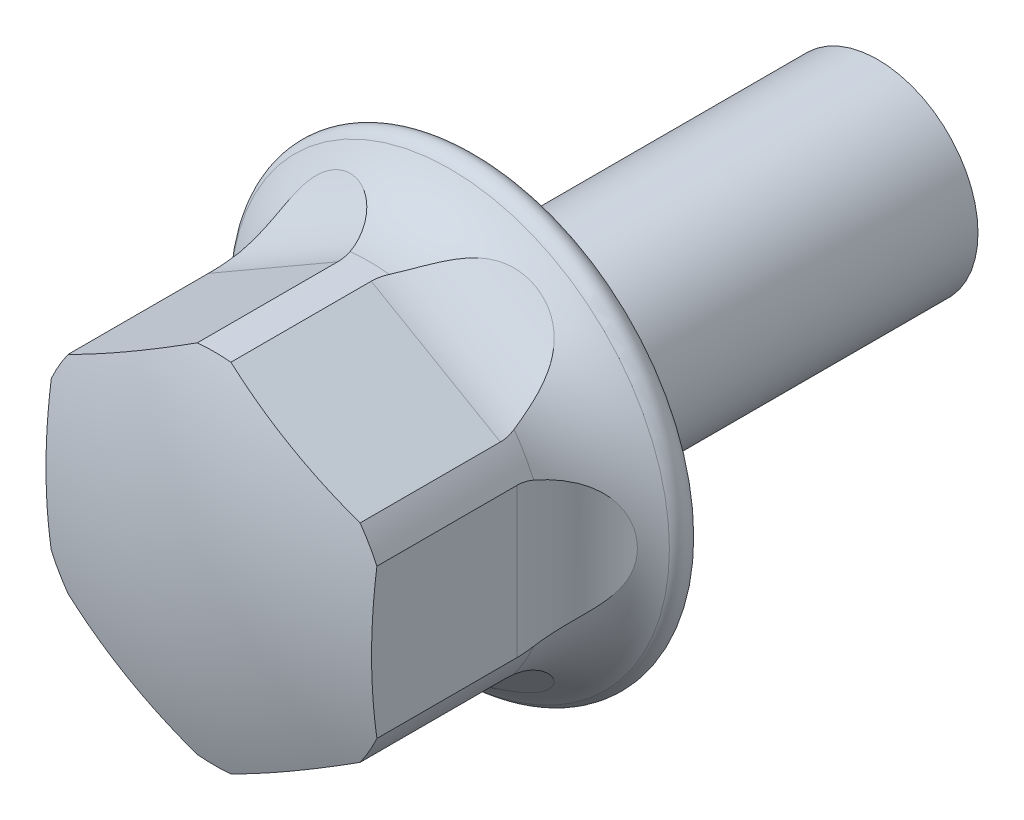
ISO-10303-21;
HEADER;
FILE_DESCRIPTION(('STEP AP214'),'2;1');
FILE_NAME('part.step','',(''),(''),'','','');
FILE_SCHEMA(('AUTOMOTIVE_DESIGN { 1 0 10303 214 1 1 1 1 }'));
ENDSEC;
DATA;
#1=APPLICATION_CONTEXT('core data for automotive mechanical design processes');
#2=APPLICATION_PROTOCOL_DEFINITION('international standard','automotive_design',2000,#1);
#3=PRODUCT_CONTEXT('',#1,'mechanical');
#4=PRODUCT('Part','Part','',(#3));
#5=PRODUCT_RELATED_PRODUCT_CATEGORY('part','',(#4));
#6=PRODUCT_DEFINITION_FORMATION('','',#4);
#7=PRODUCT_DEFINITION_CONTEXT('part definition',#1,'design');
#8=PRODUCT_DEFINITION('design','',#6,#7);
#9=PRODUCT_DEFINITION_SHAPE('','',#8);
#10=(LENGTH_UNIT() NAMED_UNIT(*) SI_UNIT(.MILLI.,.METRE.));
#11=(NAMED_UNIT(*) PLANE_ANGLE_UNIT() SI_UNIT($,.RADIAN.));
#12=(NAMED_UNIT(*) SI_UNIT($,.STERADIAN.) SOLID_ANGLE_UNIT());
#13=UNCERTAINTY_MEASURE_WITH_UNIT(LENGTH_MEASURE(1.E-05),#10,'distance_accuracy_value','');
#14=(GEOMETRIC_REPRESENTATION_CONTEXT(3) GLOBAL_UNCERTAINTY_ASSIGNED_CONTEXT((#13)) GLOBAL_UNIT_ASSIGNED_CONTEXT((#10,
#11,#12)) REPRESENTATION_CONTEXT('',''));
#15=CARTESIAN_POINT('',(0.,0.,0.));
#16=DIRECTION('',(0.,0.,1.));
#17=DIRECTION('',(1.,0.,0.));
#18=AXIS2_PLACEMENT_3D('',#15,#16,#17);
#19=CARTESIAN_POINT('',(0.,0.,0.));
#20=DIRECTION('',(0.,0.,1.));
#21=DIRECTION('',(1.,0.,0.));
#22=AXIS2_PLACEMENT_3D('',#19,#20,#21);
#23=CYLINDRICAL_SURFACE('',#22,7.15);
#24=DIRECTION('',(0.,0.,-1.));
#25=VECTOR('',#24,1.);
#26=CARTESIAN_POINT('',(0.670392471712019,7.1185022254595,11.7));
#27=LINE('',#26,#25);
#28=CARTESIAN_POINT('',(0.670392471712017,7.1185022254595,10.5016762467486));
#29=VERTEX_POINT('',#28);
#30=CARTESIAN_POINT('',(0.670392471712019,7.1185022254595,4.9));
#31=VERTEX_POINT('',#30);
#32=EDGE_CURVE('E302',#29,#31,#27,.T.);
#33=ORIENTED_EDGE('',*,*,#32,.T.);
#34=CARTESIAN_POINT('',(5.82960752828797,4.13982802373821,4.9));
#35=CARTESIAN_POINT('',(5.82960211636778,4.13984064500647,4.99617484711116));
#36=CARTESIAN_POINT('',(5.82476639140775,4.14667190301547,5.09246736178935));
#37=CARTESIAN_POINT('',(5.80553023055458,4.17355648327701,5.28234738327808));
#38=CARTESIAN_POINT('',(5.79110781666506,4.19364018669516,5.37592815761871));
#39=CARTESIAN_POINT('',(5.75316769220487,4.24553649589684,5.55736676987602));
#40=CARTESIAN_POINT('',(5.72968862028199,4.27729924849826,5.64524709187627));
#41=CARTESIAN_POINT('',(5.67424028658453,4.35058609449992,5.81386863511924));
#42=CARTESIAN_POINT('',(5.64227327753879,4.39210759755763,5.89461174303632));
#43=CARTESIAN_POINT('',(5.5670972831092,4.4870837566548,6.05529564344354));
#44=CARTESIAN_POINT('',(5.52310330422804,4.54130162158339,6.13441409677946));
#45=CARTESIAN_POINT('',(5.42674149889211,4.65602944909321,6.28227784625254));
#46=CARTESIAN_POINT('',(5.37436740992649,4.71654410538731,6.35101530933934));
#47=CARTESIAN_POINT('',(5.23381834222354,4.87293573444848,6.51032116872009));
#48=CARTESIAN_POINT('',(5.14092509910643,4.97123117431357,6.5943719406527));
#49=CARTESIAN_POINT('',(4.94114113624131,5.16987038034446,6.74082650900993));
#50=CARTESIAN_POINT('',(4.83421942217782,5.27021825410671,6.80318122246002));
#51=CARTESIAN_POINT('',(4.64973935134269,5.43246313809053,6.88927604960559));
#52=CARTESIAN_POINT('',(4.57550608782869,5.49516978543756,6.91883109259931));
#53=CARTESIAN_POINT('',(4.42293262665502,5.61869995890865,6.97044469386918));
#54=CARTESIAN_POINT('',(4.34459131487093,5.67952296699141,6.99250120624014));
#55=CARTESIAN_POINT('',(4.18434844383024,5.79859476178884,7.0295139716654));
#56=CARTESIAN_POINT('',(4.10244616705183,5.8568430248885,7.04446878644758));
#57=CARTESIAN_POINT('',(3.93555694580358,5.97026591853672,7.0675694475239));
#58=CARTESIAN_POINT('',(3.85056856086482,6.02543908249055,7.07571207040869));
#59=CARTESIAN_POINT('',(3.67706499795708,6.1328804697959,7.08539343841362));
#60=CARTESIAN_POINT('',(3.58852069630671,6.18510850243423,7.08685599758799));
#61=CARTESIAN_POINT('',(3.40941292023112,6.28561421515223,7.08300143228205));
#62=CARTESIAN_POINT('',(3.31885032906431,6.33389358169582,7.07768721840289));
#63=CARTESIAN_POINT('',(3.13626286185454,6.426259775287,7.06017507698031));
#64=CARTESIAN_POINT('',(3.04423811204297,6.47034696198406,7.04797774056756));
#65=CARTESIAN_POINT('',(2.85944107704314,6.55411356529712,7.01645910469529));
#66=CARTESIAN_POINT('',(2.7666689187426,6.59379371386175,6.99713899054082));
#67=CARTESIAN_POINT('',(2.5163643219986,6.6947104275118,6.93490493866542));
#68=CARTESIAN_POINT('',(2.35877045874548,6.75169121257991,6.88493235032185));
#69=CARTESIAN_POINT('',(2.04886790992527,6.8520848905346,6.76087892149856));
#70=CARTESIAN_POINT('',(1.8965521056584,6.89551674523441,6.68683207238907));
#71=CARTESIAN_POINT('',(1.64008295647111,6.96029429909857,6.5330928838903));
#72=CARTESIAN_POINT('',(1.53321305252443,6.98444205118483,6.45913322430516));
#73=CARTESIAN_POINT('',(1.3312306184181,7.02573148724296,6.29493938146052));
#74=CARTESIAN_POINT('',(1.23610235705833,7.04288261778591,6.20472738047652));
#75=CARTESIAN_POINT('',(1.07863661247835,7.06853892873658,6.02607687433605));
#76=CARTESIAN_POINT('',(1.01348065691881,7.07804737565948,5.94027581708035));
#77=CARTESIAN_POINT('',(0.897846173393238,7.09364376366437,5.75893980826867));
#78=CARTESIAN_POINT('',(0.847362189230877,7.09973297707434,5.66340849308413));
#79=CARTESIAN_POINT('',(0.763842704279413,7.10920854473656,5.46407338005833));
#80=CARTESIAN_POINT('',(0.730920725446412,7.11257738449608,5.36022063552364));
#81=CARTESIAN_POINT('',(0.685368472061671,7.11711428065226,5.1480998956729));
#82=CARTESIAN_POINT('',(0.672727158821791,7.118283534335,5.03983433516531));
#83=CARTESIAN_POINT('',(0.668873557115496,7.11864420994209,4.83501332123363));
#84=CARTESIAN_POINT('',(0.675435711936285,7.11804101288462,4.73849376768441));
#85=CARTESIAN_POINT('',(0.704885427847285,7.11518467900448,4.54803038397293));
#86=CARTESIAN_POINT('',(0.727770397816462,7.11293180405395,4.45408614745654));
#87=CARTESIAN_POINT('',(0.788080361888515,7.10649846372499,4.27270193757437));
#88=CARTESIAN_POINT('',(0.825278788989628,7.10234785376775,4.18518473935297));
#89=CARTESIAN_POINT('',(0.912345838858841,7.09168824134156,4.01689711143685));
#90=CARTESIAN_POINT('',(0.962217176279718,7.08517873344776,3.93612813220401));
#91=CARTESIAN_POINT('',(1.07796380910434,7.06853769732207,3.77482528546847));
#92=CARTESIAN_POINT('',(1.14493762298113,7.05811027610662,3.69511407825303));
#93=CARTESIAN_POINT('',(1.28871292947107,7.03328230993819,3.54586442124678));
#94=CARTESIAN_POINT('',(1.3655209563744,7.01887911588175,3.47633280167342));
#95=CARTESIAN_POINT('',(1.56627869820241,6.97741126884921,3.31546538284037));
#96=CARTESIAN_POINT('',(1.69471623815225,6.94760986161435,3.23041808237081));
#97=CARTESIAN_POINT('',(1.96075437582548,6.8772783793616,3.0815549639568));
#98=CARTESIAN_POINT('',(2.09837487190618,6.83672439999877,3.01778717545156));
#99=CARTESIAN_POINT('',(2.32739896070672,6.76126171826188,2.9289485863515));
#100=CARTESIAN_POINT('',(2.41772189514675,6.72952434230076,2.89819544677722));
#101=CARTESIAN_POINT('',(2.59896665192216,6.66162333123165,2.84412740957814));
#102=CARTESIAN_POINT('',(2.68988863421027,6.62545846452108,2.82081458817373));
#103=CARTESIAN_POINT('',(2.87145143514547,6.54881558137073,2.78122250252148));
#104=CARTESIAN_POINT('',(2.96209219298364,6.50833669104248,2.76494466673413));
#105=CARTESIAN_POINT('',(3.14241752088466,6.42321237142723,2.73911377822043));
#106=CARTESIAN_POINT('',(3.23210162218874,6.37856499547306,2.72956388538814));
#107=CARTESIAN_POINT('',(3.41096316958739,6.28475572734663,2.71693789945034));
#108=CARTESIAN_POINT('',(3.50012064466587,6.23554484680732,2.71394330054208));
#109=CARTESIAN_POINT('',(3.67619529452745,6.13338758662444,2.71460764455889));
#110=CARTESIAN_POINT('',(3.76311336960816,6.08044274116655,2.71826386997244));
#111=CARTESIAN_POINT('',(3.93422805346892,5.97115196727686,2.73229823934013));
#112=CARTESIAN_POINT('',(4.01842467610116,5.91480605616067,2.74267634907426));
#113=CARTESIAN_POINT('',(4.18358488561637,5.79916163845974,2.77035982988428));
#114=CARTESIAN_POINT('',(4.26454891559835,5.73986353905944,2.78766424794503));
#115=CARTESIAN_POINT('',(4.41277037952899,5.62650290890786,2.82689552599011));
#116=CARTESIAN_POINT('',(4.48046993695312,5.5727214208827,2.84796587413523));
#117=CARTESIAN_POINT('',(4.61264235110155,5.46382282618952,2.89594527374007));
#118=CARTESIAN_POINT('',(4.67711575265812,5.40870594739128,2.92285333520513));
#119=CARTESIAN_POINT('',(4.80240197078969,5.29777544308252,2.98283389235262));
#120=CARTESIAN_POINT('',(4.86321808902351,5.24196250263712,3.01590071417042));
#121=CARTESIAN_POINT('',(4.98079951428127,5.13037172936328,3.08857321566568));
#122=CARTESIAN_POINT('',(5.03756600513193,5.07459389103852,3.12817697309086));
#123=CARTESIAN_POINT('',(5.17430584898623,4.93586001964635,3.23620146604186));
#124=CARTESIAN_POINT('',(5.25144696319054,4.85346770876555,3.30905020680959));
#125=CARTESIAN_POINT('',(5.39361798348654,4.69496631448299,3.47145127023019));
#126=CARTESIAN_POINT('',(5.45866469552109,4.61884859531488,3.56098006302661));
#127=CARTESIAN_POINT('',(5.56398546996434,4.49111596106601,3.7385577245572));
#128=CARTESIAN_POINT('',(5.60661636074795,4.4375737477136,3.82381115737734));
#129=CARTESIAN_POINT('',(5.68149281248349,4.34129812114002,4.00449170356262));
#130=CARTESIAN_POINT('',(5.71374214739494,4.29856078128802,4.09991510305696));
#131=CARTESIAN_POINT('',(5.7638379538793,4.23110382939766,4.28747356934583));
#132=CARTESIAN_POINT('',(5.782907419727,4.20488539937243,4.37874291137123));
#133=CARTESIAN_POINT('',(5.81158457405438,4.16516569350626,4.56530302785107));
#134=CARTESIAN_POINT('',(5.82121625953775,4.15163216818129,4.66058295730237));
#135=CARTESIAN_POINT('',(5.82841404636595,4.14150782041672,4.80420158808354));
#136=CARTESIAN_POINT('',(5.82961022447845,4.13982173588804,4.85208619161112));
#137=CARTESIAN_POINT('',(5.82960752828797,4.13982802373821,4.9));
#138=B_SPLINE_CURVE_WITH_KNOTS('',3,(#34,#35,#36,#37,#38,#39,#40,#41,#42,#43,#44,#45,#46,#47,
#48,#49,#50,#51,#52,#53,#54,#55,#56,#57,#58,#59,#60,#61,#62,#63,#64,#65,#66,#67,#68,#69,#70,#71,
#72,#73,#74,#75,#76,#77,#78,#79,#80,#81,#82,#83,#84,#85,#86,#87,#88,#89,#90,#91,#92,#93,#94,#95,
#96,#97,#98,#99,#100,#101,#102,#103,#104,#105,#106,#107,#108,#109,#110,#111,#112,#113,#114,#115,
#116,#117,#118,#119,#120,#121,#122,#123,#124,#125,#126,#127,#128,#129,#130,#131,#132,#133,#134,
#135,#136,#137),.UNSPECIFIED.,.T.,.F.,(4,2,2,2,2,2,2,2,2,2,2,2,2,2,2,2,2,2,2,2,2,2,2,2,2,2,2,2,
2,2,2,2,2,2,2,2,2,2,2,2,2,2,2,2,2,2,2,2,2,2,2,4),(0.,0.288374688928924,0.577412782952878,
0.865231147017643,1.15297319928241,1.46835945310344,1.78398250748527,2.25907789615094,
2.73524120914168,3.03959799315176,3.34403775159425,3.64853914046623,3.95318453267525,
4.26129586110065,4.56927490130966,4.87722749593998,5.18512886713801,5.70767059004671,
6.22947769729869,6.62463072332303,7.01924844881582,7.3424018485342,7.66543492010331,
7.99053154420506,8.31545115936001,8.60425778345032,8.8930185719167,9.1773850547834,
9.46181250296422,9.77453409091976,10.0874645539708,10.5555918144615,11.0247686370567,
11.3260849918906,11.6274853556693,11.9289468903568,12.230549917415,12.5358816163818,
12.8410885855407,13.1462940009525,13.451457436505,13.7181920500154,13.9848814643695,
14.2513263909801,14.5176931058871,14.9191569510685,15.3200586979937,15.6467290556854,
15.9732805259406,16.2625967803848,16.5511754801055,16.694842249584),.UNSPECIFIED.);
#139=CARTESIAN_POINT('',(0.78506631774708,7.10676936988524,4.28747881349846));
#140=VERTEX_POINT('',#139);
#141=EDGE_CURVE('E458',#31,#140,#138,.T.);
#142=ORIENTED_EDGE('',*,*,#141,.T.);
#143=CARTESIAN_POINT('',(0.,0.,4.28747881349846));
#144=DIRECTION('',(0.,0.,1.));
#145=DIRECTION('',(1.,0.,0.));
#146=AXIS2_PLACEMENT_3D('',#143,#144,#145);
#147=CIRCLE('',#146,7.15);
#148=CARTESIAN_POINT('',(-0.78506631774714,7.10676936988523,4.28747881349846));
#149=VERTEX_POINT('',#148);
#150=EDGE_CURVE('E351',#149,#140,#147,.F.);
#151=ORIENTED_EDGE('',*,*,#150,.F.);
#152=CARTESIAN_POINT('',(-0.670392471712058,7.1185022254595,4.9));
#153=CARTESIAN_POINT('',(-0.670406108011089,7.11850384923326,4.99617484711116));
#154=CARTESIAN_POINT('',(-0.678740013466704,7.11773161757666,5.09246736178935));
#155=CARTESIAN_POINT('',(-0.711640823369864,7.1145149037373,5.28234738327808));
#156=CARTESIAN_POINT('',(-0.736245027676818,7.11206657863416,5.37592815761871));
#157=CARTESIAN_POINT('',(-0.800158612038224,7.10515762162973,5.55736676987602));
#158=CARTESIAN_POINT('',(-0.839405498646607,7.10070552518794,5.64524709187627));
#159=CARTESIAN_POINT('',(-0.930597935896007,7.08932928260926,5.81386863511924));
#160=CARTESIAN_POINT('',(-0.982540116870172,7.08240579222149,5.89461174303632));
#161=CARTESIAN_POINT('',(-1.102379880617,7.0647895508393,6.05529564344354));
#162=CARTESIAN_POINT('',(-1.17133091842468,7.05379857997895,6.13441409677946));
#163=CARTESIAN_POINT('',(-1.31886903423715,7.02771072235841,6.28227784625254));
#164=CARTESIAN_POINT('',(-1.39746330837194,7.01261075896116,6.35101530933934));
#165=CARTESIAN_POINT('',(-1.60317696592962,6.96908751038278,6.51032116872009));
#166=CARTESIAN_POINT('',(-1.7347499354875,6.93778732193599,6.5943719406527));
#167=CARTESIAN_POINT('',(-2.00666851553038,6.8640889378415,6.74082650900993));
#168=CARTESIAN_POINT('',(-2.147033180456,6.82166595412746,6.80318122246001));
#169=CARTESIAN_POINT('',(-2.3797814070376,6.74302396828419,6.88927604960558));
#170=CARTESIAN_POINT('',(-2.47120358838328,6.71008939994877,6.91883109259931));
#171=CARTESIAN_POINT('',(-2.65447058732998,6.6397219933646,6.97044469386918));
#172=CARTESIAN_POINT('',(-2.74631551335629,6.60228793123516,6.99250120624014));
#173=CARTESIAN_POINT('',(-2.92955614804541,6.52304943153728,7.0295139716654));
#174=CARTESIAN_POINT('',(-3.02095176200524,6.48124411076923,7.04446878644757));
#175=CARTESIAN_POINT('',(-3.20262347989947,6.39342525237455,7.0675694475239));
#176=CARTESIAN_POINT('',(-3.29289903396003,6.34740973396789,7.07571207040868));
#177=CARTESIAN_POINT('',(-3.47269778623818,6.25087193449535,7.08539343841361));
#178=CARTESIAN_POINT('',(-3.56220074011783,6.20030433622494,7.08685599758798));
#179=CARTESIAN_POINT('',(-3.73879512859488,6.09544530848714,7.08300143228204));
#180=CARTESIAN_POINT('',(-3.82588758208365,6.04115548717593,7.07768721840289));
#181=CARTESIAN_POINT('',(-3.99717278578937,5.9292131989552,7.0601750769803));
#182=CARTESIAN_POINT('',(-4.08136578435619,5.87156102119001,7.04797774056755));
#183=CARTESIAN_POINT('',(-4.24630830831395,5.75340539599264,7.01645910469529));
#184=CARTESIAN_POINT('',(-4.32705840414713,5.69290242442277,6.99713899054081));
#185=CARTESIAN_POINT('',(-4.53960714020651,5.52659064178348,6.93490493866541));
#186=CARTESIAN_POINT('',(-4.66775087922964,5.4186007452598,6.88493235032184));
#187=CARTESIAN_POINT('',(-4.90964562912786,5.2004141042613,6.76087892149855));
#188=CARTESIAN_POINT('',(-5.02341662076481,5.09022067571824,6.68683207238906));
#189=CARTESIAN_POINT('',(-5.20775020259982,4.90050065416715,6.53309288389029));
#190=CARTESIAN_POINT('',(-5.28209772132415,4.82002247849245,6.45913322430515));
#191=CARTESIAN_POINT('',(-5.41884663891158,4.66574527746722,6.29493938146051));
#192=CARTESIAN_POINT('',(-5.4812640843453,4.59193735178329,6.20472738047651));
#193=CARTESIAN_POINT('',(-5.58221597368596,4.46839617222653,6.02607687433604));
#194=CARTESIAN_POINT('',(-5.62302850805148,4.41672368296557,5.94027581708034));
#195=CARTESIAN_POINT('',(-5.69435261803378,4.32437947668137,5.75893980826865));
#196=CARTESIAN_POINT('',(-5.72486802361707,4.2837036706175,5.66340849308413));
#197=CARTESIAN_POINT('',(-5.77483384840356,4.21611145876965,5.46407338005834));
#198=CARTESIAN_POINT('',(-5.79421233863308,4.18928460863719,5.36022063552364));
#199=CARTESIAN_POINT('',(-5.82091753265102,4.15210364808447,5.14809989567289));
#200=CARTESIAN_POINT('',(-5.82825079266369,4.14174057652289,5.03983433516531));
#201=CARTESIAN_POINT('',(-5.83048994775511,4.13858359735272,4.83501332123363));
#202=CARTESIAN_POINT('',(-5.82668648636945,4.14396499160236,4.73849376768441));
#203=CARTESIAN_POINT('',(-5.80948797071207,4.16804102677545,4.54803038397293));
#204=CARTESIAN_POINT('',(-5.79609443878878,4.18673355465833,4.45408614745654));
#205=CARTESIAN_POINT('',(-5.76036802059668,4.23574684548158,4.27270193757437));
#206=CARTESIAN_POINT('',(-5.73817427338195,4.26588632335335,4.18518473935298));
#207=CARTESIAN_POINT('',(-5.68540925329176,4.33595879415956,4.01689711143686));
#208=CARTESIAN_POINT('',(-5.65483618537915,4.37589388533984,3.93612813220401));
#209=CARTESIAN_POINT('',(-5.5825513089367,4.46781289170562,3.77482528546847));
#210=CARTESIAN_POINT('',(-5.54003399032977,4.52060020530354,3.69511407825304));
#211=CARTESIAN_POINT('',(-5.44664468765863,4.6326992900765,3.54586442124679));
#212=CARTESIAN_POINT('',(-5.39576714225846,4.69201539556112,3.47633280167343));
#213=CARTESIAN_POINT('',(-5.25947606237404,4.84514277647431,3.31546538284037));
#214=CARTESIAN_POINT('',(-5.16944851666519,4.94147224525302,3.23041808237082));
#215=CARTESIAN_POINT('',(-4.97552059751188,5.13670228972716,3.08155496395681));
#216=CARTESIAN_POINT('',(-4.87158957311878,5.23560814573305,3.01778717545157));
#217=CARTESIAN_POINT('',(-4.69172492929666,5.39621748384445,2.9289485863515));
#218=CARTESIAN_POINT('',(-4.61907808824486,5.45857075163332,2.89819544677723));
#219=CARTESIAN_POINT('',(-4.46965170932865,5.581582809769,2.84412740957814));
#220=CARTESIAN_POINT('',(-4.39287102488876,5.64224112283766,2.82081458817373));
#221=CARTESIAN_POINT('',(-4.23571494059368,5.76115767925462,2.78122250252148));
#222=CARTESIAN_POINT('',(-4.15533881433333,5.81941543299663,2.76494466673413));
#223=CARTESIAN_POINT('',(-3.99145632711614,5.93301958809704,2.73911377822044));
#224=CARTESIAN_POINT('',(-3.90794851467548,5.98836461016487,2.72956388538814));
#225=CARTESIAN_POINT('',(-3.73727653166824,6.09635861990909,2.71693789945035));
#226=CARTESIAN_POINT('',(-3.65007992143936,6.14896581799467,2.71394330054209));
#227=CARTESIAN_POINT('',(-3.47357181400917,6.25037230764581,2.7146076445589));
#228=CARTESIAN_POINT('',(-3.38426119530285,6.2991731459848,2.71826386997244));
#229=CARTESIAN_POINT('',(-3.20405526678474,6.39271742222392,2.73229823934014));
#230=CARTESIAN_POINT('',(-3.11315996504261,6.43746088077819,2.74267634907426));
#231=CARTESIAN_POINT('',(-2.93042885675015,6.52267160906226,2.77035982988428));
#232=CARTESIAN_POINT('',(-2.83859318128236,6.56313946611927,2.78766424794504));
#233=CARTESIAN_POINT('',(-2.66630926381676,6.63482270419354,2.82689552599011));
#234=CARTESIAN_POINT('',(-2.58588335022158,6.66656149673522,2.84796587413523));
#235=CARTESIAN_POINT('',(-2.42548819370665,6.72657686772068,2.89594527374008));
#236=CARTESIAN_POINT('',(-2.34551887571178,6.75485403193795,2.92285333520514));
#237=CARTESIAN_POINT('',(-2.18680713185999,6.80788982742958,2.98283389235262));
#238=CARTESIAN_POINT('',(-2.10806364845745,6.83265166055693,3.01590071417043));
#239=CARTESIAN_POINT('',(-1.95263249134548,6.87868477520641,3.08857321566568));
#240=CARTESIAN_POINT('',(-1.87594422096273,6.89995707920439,3.12817697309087));
#241=CARTESIAN_POINT('',(-1.6874272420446,6.94901032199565,3.23620146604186));
#242=CARTESIAN_POINT('',(-1.57750285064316,6.97462033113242,3.30905020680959));
#243=CARTESIAN_POINT('',(-1.36915110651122,7.01849334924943,3.4714512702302));
#244=CARTESIAN_POINT('',(-1.27070787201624,7.03676659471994,3.56098006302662));
#245=CARTESIAN_POINT('',(-1.10742777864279,7.06411074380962,3.7385577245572));
#246=CARTESIAN_POINT('',(-1.03974341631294,7.07425907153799,3.82381115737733));
#247=CARTESIAN_POINT('',(-0.918928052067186,7.09096616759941,4.00449170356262));
#248=CARTESIAN_POINT('',(-0.865791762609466,7.09752624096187,4.09991510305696));
#249=CARTESIAN_POINT('',(-0.782324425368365,7.10718200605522,4.28747356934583));
#250=CARTESIAN_POINT('',(-0.75008386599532,7.11058743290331,4.37874291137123));
#251=CARTESIAN_POINT('',(-0.701347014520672,7.11556272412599,4.56530302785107));
#252=CARTESIAN_POINT('',(-0.684810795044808,7.11713724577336,4.66058295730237));
#253=CARTESIAN_POINT('',(-0.672443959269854,7.11830853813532,4.80420158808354));
#254=CARTESIAN_POINT('',(-0.670385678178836,7.11850141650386,4.85208619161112));
#255=CARTESIAN_POINT('',(-0.670392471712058,7.1185022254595,4.9));
#256=B_SPLINE_CURVE_WITH_KNOTS('',3,(#152,#153,#154,#155,#156,#157,#158,#159,#160,#161,#162,
#163,#164,#165,#166,#167,#168,#169,#170,#171,#172,#173,#174,#175,#176,#177,#178,#179,#180,#181,
#182,#183,#184,#185,#186,#187,#188,#189,#190,#191,#192,#193,#194,#195,#196,#197,#198,#199,#200,
#201,#202,#203,#204,#205,#206,#207,#208,#209,#210,#211,#212,#213,#214,#215,#216,#217,#218,#219,
#220,#221,#222,#223,#224,#225,#226,#227,#228,#229,#230,#231,#232,#233,#234,#235,#236,#237,#238,
#239,#240,#241,#242,#243,#244,#245,#246,#247,#248,#249,#250,#251,#252,#253,#254,#255),
.UNSPECIFIED.,.T.,.F.,(4,2,2,2,2,2,2,2,2,2,2,2,2,2,2,2,2,2,2,2,2,2,2,2,2,2,2,2,2,2,2,2,2,2,2,2,
2,2,2,2,2,2,2,2,2,2,2,2,2,2,2,4),(0.,0.288374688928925,0.57741278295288,0.865231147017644,
1.15297319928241,1.46835945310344,1.78398250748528,2.25907789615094,2.73524120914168,
3.03959799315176,3.34403775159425,3.64853914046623,3.95318453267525,4.26129586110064,
4.56927490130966,4.87722749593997,5.18512886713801,5.7076705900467,6.22947769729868,
6.62463072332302,7.01924844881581,7.34240184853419,7.66543492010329,7.99053154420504,
8.31545115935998,8.6042577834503,8.89301857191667,9.17738505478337,9.46181250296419,
9.77453409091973,10.0874645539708,10.5555918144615,11.0247686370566,11.3260849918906,
11.6274853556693,11.9289468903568,12.230549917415,12.5358816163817,12.8410885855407,
13.1462940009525,13.451457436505,13.7181920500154,13.9848814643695,14.25132639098,
14.517693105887,14.9191569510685,15.3200586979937,15.6467290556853,15.9732805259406,
16.2625967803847,16.5511754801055,16.6948422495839),.UNSPECIFIED.);
#257=CARTESIAN_POINT('',(-0.670392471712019,7.11850222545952,4.9));
#258=VERTEX_POINT('',#257);
#259=EDGE_CURVE('E307',#149,#258,#256,.T.);
#260=ORIENTED_EDGE('',*,*,#259,.T.);
#261=DIRECTION('',(0.,0.,-1.));
#262=VECTOR('',#261,1.);
#263=CARTESIAN_POINT('',(-0.670392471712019,7.1185022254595,11.7));
#264=LINE('',#263,#262);
#265=CARTESIAN_POINT('',(-0.67039247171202,7.1185022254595,10.5016762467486));
#266=VERTEX_POINT('',#265);
#267=EDGE_CURVE('E305',#266,#258,#264,.T.);
#268=ORIENTED_EDGE('',*,*,#267,.F.);
#269=CARTESIAN_POINT('',(0.,0.,10.5016762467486));
#270=DIRECTION('',(0.,0.,1.));
#271=DIRECTION('',(1.,0.,0.));
#272=AXIS2_PLACEMENT_3D('',#269,#270,#271);
#273=CIRCLE('',#272,7.15);
#274=EDGE_CURVE('E195',#29,#266,#273,.T.);
#275=ORIENTED_EDGE('',*,*,#274,.F.);
#276=EDGE_LOOP('',(#33,#142,#151,#260,#268,#275));
#277=FACE_BOUND('',#276,.T.);
#278=ADVANCED_FACE('F16',(#277),#23,.T.);
#279=DIRECTION('',(0.,0.,-1.));
#280=VECTOR('',#279,1.);
#281=CARTESIAN_POINT('',(-5.82960752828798,4.1398280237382,11.7));
#282=LINE('',#281,#280);
#283=CARTESIAN_POINT('',(-5.82960752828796,4.13982802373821,10.5016762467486));
#284=VERTEX_POINT('',#283);
#285=CARTESIAN_POINT('',(-5.82960752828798,4.1398280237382,4.9));
#286=VERTEX_POINT('',#285);
#287=EDGE_CURVE('E311',#284,#286,#282,.T.);
#288=ORIENTED_EDGE('',*,*,#287,.T.);
#289=CARTESIAN_POINT('',(-5.76210965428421,4.23327205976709,4.28747881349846));
#290=VERTEX_POINT('',#289);
#291=EDGE_CURVE('E654',#286,#290,#256,.T.);
#292=ORIENTED_EDGE('',*,*,#291,.T.);
#293=CARTESIAN_POINT('',(-6.54717597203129,2.87349731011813,4.28747881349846));
#294=VERTEX_POINT('',#293);
#295=EDGE_CURVE('E338',#294,#290,#147,.F.);
#296=ORIENTED_EDGE('',*,*,#295,.F.);
#297=CARTESIAN_POINT('',(-7.15,0.,2.71425070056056));
#298=CARTESIAN_POINT('',(-7.1500021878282,0.0976074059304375,2.71425253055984));
#299=CARTESIAN_POINT('',(-7.14799956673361,0.195190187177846,2.71730889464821));
#300=CARTESIAN_POINT('',(-7.14002999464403,0.389798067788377,2.72959418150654));
#301=CARTESIAN_POINT('',(-7.13406390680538,0.486823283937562,2.73882176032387));
#302=CARTESIAN_POINT('',(-7.11825669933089,0.679948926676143,2.76364141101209));
#303=CARTESIAN_POINT('',(-7.10840742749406,0.776046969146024,2.77924687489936));
#304=CARTESIAN_POINT('',(-7.08503296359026,0.966436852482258,2.81709444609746));
#305=CARTESIAN_POINT('',(-7.07150941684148,1.06072948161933,2.83933358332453));
#306=CARTESIAN_POINT('',(-7.04094946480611,1.24762597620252,2.89105004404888));
#307=CARTESIAN_POINT('',(-7.02388412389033,1.34020862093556,2.92058739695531));
#308=CARTESIAN_POINT('',(-6.98674520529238,1.52200482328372,2.98727981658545));
#309=CARTESIAN_POINT('',(-6.96667103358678,1.61121771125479,3.02443638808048));
#310=CARTESIAN_POINT('',(-6.92418362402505,1.78497971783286,3.10676918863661));
#311=CARTESIAN_POINT('',(-6.90177735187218,1.86954163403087,3.15192180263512));
#312=CARTESIAN_POINT('',(-6.85541078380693,2.03299274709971,3.25077392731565));
#313=CARTESIAN_POINT('',(-6.83145162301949,2.11188600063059,3.30446723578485));
#314=CARTESIAN_POINT('',(-6.7775604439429,2.27959396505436,3.43391584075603));
#315=CARTESIAN_POINT('',(-6.74749436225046,2.36666355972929,3.51191819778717));
#316=CARTESIAN_POINT('',(-6.68905169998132,2.52713148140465,3.68151997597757));
#317=CARTESIAN_POINT('',(-6.66067434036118,2.60053614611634,3.77311305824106));
#318=CARTESIAN_POINT('',(-6.60828884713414,2.73093801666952,3.96993038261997));
#319=CARTESIAN_POINT('',(-6.58432518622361,2.78777126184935,4.07527683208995));
#320=CARTESIAN_POINT('',(-6.54425262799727,2.88060103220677,4.29618793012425));
#321=CARTESIAN_POINT('',(-6.52813504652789,2.91662060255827,4.41174111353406));
#322=CARTESIAN_POINT('',(-6.50776716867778,2.96175259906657,4.63099565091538));
#323=CARTESIAN_POINT('',(-6.50211171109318,2.97406252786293,4.73391418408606));
#324=CARTESIAN_POINT('',(-6.49887467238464,2.98113293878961,4.94046262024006));
#325=CARTESIAN_POINT('',(-6.50128902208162,2.97590226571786,5.04409213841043));
#326=CARTESIAN_POINT('',(-6.51333186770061,2.94943728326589,5.23943354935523));
#327=CARTESIAN_POINT('',(-6.52230414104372,2.9296577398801,5.33138945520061));
#328=CARTESIAN_POINT('',(-6.54584015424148,2.87668402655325,5.51056307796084));
#329=CARTESIAN_POINT('',(-6.56040379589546,2.84349009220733,5.59778087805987));
#330=CARTESIAN_POINT('',(-6.59455477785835,2.76338665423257,5.76917113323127));
#331=CARTESIAN_POINT('',(-6.61432649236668,2.71596232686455,5.85306436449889));
#332=CARTESIAN_POINT('',(-6.65692438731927,2.60981462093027,6.01247117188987));
#333=CARTESIAN_POINT('',(-6.67975217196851,2.55108530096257,6.08798030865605));
#334=CARTESIAN_POINT('',(-6.73651563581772,2.39810603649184,6.25916618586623));
#335=CARTESIAN_POINT('',(-6.771168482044,2.29916456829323,6.35042009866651));
#336=CARTESIAN_POINT('',(-6.83951512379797,2.08709714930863,6.51519621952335));
#337=CARTESIAN_POINT('',(-6.87320679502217,1.97394237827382,6.58868148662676));
#338=CARTESIAN_POINT('',(-6.92577548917,1.77836802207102,6.69642781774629));
#339=CARTESIAN_POINT('',(-6.94575381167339,1.69881081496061,6.73547518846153));
#340=CARTESIAN_POINT('',(-6.98351823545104,1.53621317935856,6.80682440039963));
#341=CARTESIAN_POINT('',(-7.00130366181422,1.45317168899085,6.83912416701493));
#342=CARTESIAN_POINT('',(-7.05067491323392,1.19996971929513,6.92650296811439));
#343=CARTESIAN_POINT('',(-7.07829061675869,1.02567768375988,6.97209013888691));
#344=CARTESIAN_POINT('',(-7.12106388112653,0.667942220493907,7.04112953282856));
#345=CARTESIAN_POINT('',(-7.13597009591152,0.484386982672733,7.06413648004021));
#346=CARTESIAN_POINT('',(-7.15145962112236,0.115072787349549,7.08803541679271));
#347=CARTESIAN_POINT('',(-7.15203403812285,-0.070687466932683,7.08891367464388));
#348=CARTESIAN_POINT('',(-7.14157176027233,-0.363626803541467,7.07277886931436));
#349=CARTESIAN_POINT('',(-7.13525145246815,-0.471446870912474,7.06303436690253));
#350=CARTESIAN_POINT('',(-7.11784924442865,-0.685756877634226,7.03572705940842));
#351=CARTESIAN_POINT('',(-7.10676626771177,-0.792246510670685,7.01816248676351));
#352=CARTESIAN_POINT('',(-7.08010918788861,-1.00290384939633,6.97484764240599));
#353=CARTESIAN_POINT('',(-7.06453845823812,-1.10707323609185,6.94910351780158));
#354=CARTESIAN_POINT('',(-7.02934492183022,-1.31211077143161,6.88891000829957));
#355=CARTESIAN_POINT('',(-7.0097239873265,-1.41298042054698,6.85446464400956));
#356=CARTESIAN_POINT('',(-6.95872664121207,-1.64870018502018,6.76098237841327));
#357=CARTESIAN_POINT('',(-6.92574464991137,-1.78152733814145,6.69759057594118));
#358=CARTESIAN_POINT('',(-6.85569658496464,-2.03447549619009,6.55094671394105));
#359=CARTESIAN_POINT('',(-6.81863752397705,-2.15461764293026,6.46772847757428));
#360=CARTESIAN_POINT('',(-6.75207476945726,-2.35385692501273,6.29978569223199));
#361=CARTESIAN_POINT('',(-6.7226111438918,-2.43628411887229,6.21901267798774));
#362=CARTESIAN_POINT('',(-6.66609488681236,-2.58691713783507,6.04435984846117));
#363=CARTESIAN_POINT('',(-6.63903980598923,-2.65513750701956,5.95049360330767));
#364=CARTESIAN_POINT('',(-6.59387360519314,-2.76520256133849,5.76591009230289));
#365=CARTESIAN_POINT('',(-6.57503009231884,-2.8094653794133,5.67681878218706));
#366=CARTESIAN_POINT('',(-6.54291277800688,-2.88347541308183,5.49182120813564));
#367=CARTESIAN_POINT('',(-6.52963681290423,-2.91322826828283,5.39591760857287));
#368=CARTESIAN_POINT('',(-6.50999900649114,-2.9568567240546,5.19944531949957));
#369=CARTESIAN_POINT('',(-6.50366441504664,-2.97066976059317,5.09885984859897));
#370=CARTESIAN_POINT('',(-6.49872372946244,-2.9814645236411,4.89660015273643));
#371=CARTESIAN_POINT('',(-6.5001162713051,-2.9784492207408,4.79492612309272));
#372=CARTESIAN_POINT('',(-6.5100993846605,-2.95655638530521,4.60085612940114));
#373=CARTESIAN_POINT('',(-6.51818509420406,-2.93879115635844,4.50830506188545));
#374=CARTESIAN_POINT('',(-6.54011517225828,-2.88965582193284,4.32763822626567));
#375=CARTESIAN_POINT('',(-6.5539595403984,-2.85828571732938,4.2395224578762));
#376=CARTESIAN_POINT('',(-6.58672949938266,-2.78195297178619,4.06674379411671));
#377=CARTESIAN_POINT('',(-6.60581198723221,-2.7365640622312,3.98230047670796));
#378=CARTESIAN_POINT('',(-6.64722739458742,-2.63437134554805,3.82155293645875));
#379=CARTESIAN_POINT('',(-6.66956186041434,-2.57756210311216,3.74525261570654));
#380=CARTESIAN_POINT('',(-6.72508197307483,-2.42984858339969,3.57292089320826));
#381=CARTESIAN_POINT('',(-6.75905836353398,-2.33435752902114,3.48106442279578));
#382=CARTESIAN_POINT('',(-6.82648817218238,-2.129152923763,3.31462534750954));
#383=CARTESIAN_POINT('',(-6.85994035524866,-2.01941019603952,3.24007907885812));
#384=CARTESIAN_POINT('',(-6.93326626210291,-1.75401787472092,3.08678490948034));
#385=CARTESIAN_POINT('',(-6.97192421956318,-1.59467060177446,3.01387400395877));
#386=CARTESIAN_POINT('',(-7.0392357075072,-1.26494434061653,2.89304053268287));
#387=CARTESIAN_POINT('',(-7.06788333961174,-1.09455891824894,2.84513269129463));
#388=CARTESIAN_POINT('',(-7.10997674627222,-0.770595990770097,2.77653605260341));
#389=CARTESIAN_POINT('',(-7.12493314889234,-0.617780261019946,2.75308309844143));
#390=CARTESIAN_POINT('',(-7.14494096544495,-0.309955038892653,2.72194227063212));
#391=CARTESIAN_POINT('',(-7.14999652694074,-0.154946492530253,2.71424779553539));
#392=CARTESIAN_POINT('',(-7.15,0.,2.71425070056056));
#393=B_SPLINE_CURVE_WITH_KNOTS('',3,(#297,#298,#299,#300,#301,#302,#303,#304,#305,#306,#307,
#308,#309,#310,#311,#312,#313,#314,#315,#316,#317,#318,#319,#320,#321,#322,#323,#324,#325,#326,
#327,#328,#329,#330,#331,#332,#333,#334,#335,#336,#337,#338,#339,#340,#341,#342,#343,#344,#345,
#346,#347,#348,#349,#350,#351,#352,#353,#354,#355,#356,#357,#358,#359,#360,#361,#362,#363,#364,
#365,#366,#367,#368,#369,#370,#371,#372,#373,#374,#375,#376,#377,#378,#379,#380,#381,#382,#383,
#384,#385,#386,#387,#388,#389,#390,#391,#392),.UNSPECIFIED.,.T.,.F.,(4,2,2,2,2,2,2,2,2,2,2,2,2,
2,2,2,2,2,2,2,2,2,2,2,2,2,2,2,2,2,2,2,2,2,2,2,2,2,2,2,2,2,2,2,2,2,2,4),(0.,0.292710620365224,
0.585357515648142,0.878622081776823,1.17175554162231,1.46738540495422,1.76307371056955,
2.05790288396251,2.3525189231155,2.71323284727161,3.07377905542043,3.43778011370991,
3.80137736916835,4.11106777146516,4.42060203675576,4.70278866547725,4.98497033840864,
5.27893458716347,5.57305375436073,5.98775092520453,6.40330297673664,6.6755091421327,
6.94779887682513,7.49219180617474,8.0471163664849,8.60238527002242,8.92738191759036,
9.25245206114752,9.5772784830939,9.90195508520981,10.3527677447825,10.8028167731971,
11.1587849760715,11.5143869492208,11.8168436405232,12.1191826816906,12.4227044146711,
12.7261725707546,13.0086370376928,13.2911014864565,13.5831792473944,13.8753963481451,
14.2834987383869,14.6924501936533,15.227938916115,15.7637426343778,16.2285997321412,
16.693262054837),.UNSPECIFIED.);
#394=CARTESIAN_POINT('',(-6.5,2.9786742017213,4.9));
#395=VERTEX_POINT('',#394);
#396=EDGE_CURVE('E330',#294,#395,#393,.T.);
#397=ORIENTED_EDGE('',*,*,#396,.T.);
#398=DIRECTION('',(0.,0.,-1.));
#399=VECTOR('',#398,1.);
#400=CARTESIAN_POINT('',(-6.5,2.9786742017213,11.7));
#401=LINE('',#400,#399);
#402=CARTESIAN_POINT('',(-6.5,2.97867420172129,10.5016762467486));
#403=VERTEX_POINT('',#402);
#404=EDGE_CURVE('E323',#403,#395,#401,.T.);
#405=ORIENTED_EDGE('',*,*,#404,.F.);
#406=EDGE_CURVE('E290',#284,#403,#273,.T.);
#407=ORIENTED_EDGE('',*,*,#406,.F.);
#408=EDGE_LOOP('',(#288,#292,#296,#397,#405,#407));
#409=FACE_BOUND('',#408,.T.);
#410=ADVANCED_FACE('F243',(#409),#23,.T.);
#411=CARTESIAN_POINT('',(5.76210965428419,4.23327205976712,4.28747881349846));
#412=VERTEX_POINT('',#411);
#413=CARTESIAN_POINT('',(6.54717597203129,2.87349731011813,4.28747881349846));
#414=VERTEX_POINT('',#413);
#415=EDGE_CURVE('E194',#412,#414,#147,.F.);
#416=ORIENTED_EDGE('',*,*,#415,.F.);
#417=CARTESIAN_POINT('',(5.82960752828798,4.1398280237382,4.9));
#418=VERTEX_POINT('',#417);
#419=EDGE_CURVE('E459',#412,#418,#138,.T.);
#420=ORIENTED_EDGE('',*,*,#419,.T.);
#421=DIRECTION('',(0.,0.,-1.));
#422=VECTOR('',#421,1.);
#423=CARTESIAN_POINT('',(5.82960752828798,4.1398280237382,11.7));
#424=LINE('',#423,#422);
#425=CARTESIAN_POINT('',(5.82960752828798,4.1398280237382,10.5016762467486));
#426=VERTEX_POINT('',#425);
#427=EDGE_CURVE('E635',#426,#418,#424,.T.);
#428=ORIENTED_EDGE('',*,*,#427,.F.);
#429=CARTESIAN_POINT('',(6.5,2.97867420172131,10.5016762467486));
#430=VERTEX_POINT('',#429);
#431=EDGE_CURVE('E190',#430,#426,#273,.T.);
#432=ORIENTED_EDGE('',*,*,#431,.F.);
#433=DIRECTION('',(0.,0.,-1.));
#434=VECTOR('',#433,1.);
#435=CARTESIAN_POINT('',(6.5,2.9786742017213,11.7));
#436=LINE('',#435,#434);
#437=CARTESIAN_POINT('',(6.5,2.9786742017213,4.9));
#438=VERTEX_POINT('',#437);
#439=EDGE_CURVE('E314',#430,#438,#436,.T.);
#440=ORIENTED_EDGE('',*,*,#439,.T.);
#441=CARTESIAN_POINT('',(6.54717597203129,-2.87349731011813,4.28747881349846));
#442=CARTESIAN_POINT('',(6.54027784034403,-2.88921060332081,4.33197927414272));
#443=CARTESIAN_POINT('',(6.5340502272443,-2.90325095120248,4.37715740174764));
#444=CARTESIAN_POINT('',(6.52306080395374,-2.92785970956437,4.46863359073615));
#445=CARTESIAN_POINT('',(6.51829932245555,-2.93842734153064,4.51493190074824));
#446=CARTESIAN_POINT('',(6.50642284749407,-2.96468425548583,4.65491934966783));
#447=CARTESIAN_POINT('',(6.50168460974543,-2.97499727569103,4.7498975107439));
#448=CARTESIAN_POINT('',(6.49906589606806,-2.98071311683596,4.94052326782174));
#449=CARTESIAN_POINT('',(6.50119754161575,-2.97608958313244,5.03617174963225));
#450=CARTESIAN_POINT('',(6.51211544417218,-2.95212137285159,5.22516385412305));
#451=CARTESIAN_POINT('',(6.52089869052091,-2.93278335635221,5.31850849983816));
#452=CARTESIAN_POINT('',(6.54416898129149,-2.88047794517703,5.49974943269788));
#453=CARTESIAN_POINT('',(6.55861367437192,-2.84761166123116,5.58768069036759));
#454=CARTESIAN_POINT('',(6.59193249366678,-2.76960610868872,5.75701169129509));
#455=CARTESIAN_POINT('',(6.61080903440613,-2.72446014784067,5.8384078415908));
#456=CARTESIAN_POINT('',(6.65342705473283,-2.61876583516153,6.00071320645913));
#457=CARTESIAN_POINT('',(6.67745880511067,-2.55716982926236,6.08086030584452));
#458=CARTESIAN_POINT('',(6.72715924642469,-2.42341396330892,6.23114548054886));
#459=CARTESIAN_POINT('',(6.7528287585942,-2.35124877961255,6.30127847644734));
#460=CARTESIAN_POINT('',(6.8166736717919,-2.16096746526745,6.46332933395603));
#461=CARTESIAN_POINT('',(6.85482957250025,-2.03763120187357,6.54914175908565));
#462=CARTESIAN_POINT('',(6.92684301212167,-1.77753603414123,6.69987976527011));
#463=CARTESIAN_POINT('',(6.96069051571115,-1.64074706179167,6.76475710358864));
#464=CARTESIAN_POINT('',(7.0104937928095,-1.40861132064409,6.85575197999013));
#465=CARTESIAN_POINT('',(7.02853203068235,-1.31582279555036,6.88744894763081));
#466=CARTESIAN_POINT('',(7.06120008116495,-1.12742279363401,6.94345637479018));
#467=CARTESIAN_POINT('',(7.0758289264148,-1.03181052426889,6.96776473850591));
#468=CARTESIAN_POINT('',(7.1013227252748,-0.838582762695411,7.00940420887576));
#469=CARTESIAN_POINT('',(7.11218698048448,-0.740966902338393,7.02673402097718));
#470=CARTESIAN_POINT('',(7.12992908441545,-0.544385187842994,7.0547382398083));
#471=CARTESIAN_POINT('',(7.13680506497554,-0.445418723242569,7.0654095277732));
#472=CARTESIAN_POINT('',(7.14649420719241,-0.245496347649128,7.08038514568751));
#473=CARTESIAN_POINT('',(7.14925267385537,-0.144531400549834,7.08460377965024));
#474=CARTESIAN_POINT('',(7.15048214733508,0.0574449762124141,7.08648836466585));
#475=CARTESIAN_POINT('',(7.14895486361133,0.158456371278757,7.08415692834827));
#476=CARTESIAN_POINT('',(7.14164483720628,0.3599644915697,7.07290029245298));
#477=CARTESIAN_POINT('',(7.13586183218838,0.460461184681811,7.0639746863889));
#478=CARTESIAN_POINT('',(7.12015139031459,0.660291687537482,7.03935453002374));
#479=CARTESIAN_POINT('',(7.11022443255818,0.75962563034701,7.02366076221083));
#480=CARTESIAN_POINT('',(7.08768659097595,0.946079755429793,6.98722889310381));
#481=CARTESIAN_POINT('',(7.07546807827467,1.03338520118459,6.96719541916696));
#482=CARTESIAN_POINT('',(7.04810859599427,1.20594102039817,6.92117861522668));
#483=CARTESIAN_POINT('',(7.03296808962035,1.29119171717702,6.89519622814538));
#484=CARTESIAN_POINT('',(7.00009288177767,1.45893551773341,6.83694829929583));
#485=CARTESIAN_POINT('',(6.98236046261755,1.54143096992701,6.80468827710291));
#486=CARTESIAN_POINT('',(6.94473605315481,1.70294610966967,6.73349795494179));
#487=CARTESIAN_POINT('',(6.92484470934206,1.78196682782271,6.69456964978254));
#488=CARTESIAN_POINT('',(6.87301996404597,1.9744271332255,6.58822096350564));
#489=CARTESIAN_POINT('',(6.84006279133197,2.08518252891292,6.51631921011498));
#490=CARTESIAN_POINT('',(6.77317496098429,2.29314568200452,6.35544634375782));
#491=CARTESIAN_POINT('',(6.73924576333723,2.3903725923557,6.2664997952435));
#492=CARTESIAN_POINT('',(6.68014750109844,2.55029364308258,6.08982254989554));
#493=CARTESIAN_POINT('',(6.65453233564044,2.61604272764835,6.00501995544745));
#494=CARTESIAN_POINT('',(6.60729525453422,2.73315618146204,5.82492777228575));
#495=CARTESIAN_POINT('',(6.58567175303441,2.78452626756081,5.72964237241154));
#496=CARTESIAN_POINT('',(6.54858481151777,2.87067531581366,5.5298371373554));
#497=CARTESIAN_POINT('',(6.53316493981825,2.90533726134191,5.42525807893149));
#498=CARTESIAN_POINT('',(6.51063109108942,2.95549758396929,5.21069552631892));
#499=CARTESIAN_POINT('',(6.50351407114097,2.97100298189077,5.10071402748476));
#500=CARTESIAN_POINT('',(6.49882033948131,2.9812490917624,4.89297012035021));
#501=CARTESIAN_POINT('',(6.50019625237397,2.97826921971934,4.79533429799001));
#502=CARTESIAN_POINT('',(6.50993356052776,2.95692431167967,4.60220516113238));
#503=CARTESIAN_POINT('',(6.51828365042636,2.93858417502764,4.50670863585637));
#504=CARTESIAN_POINT('',(6.53227909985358,2.90720944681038,4.39239784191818));
#505=CARTESIAN_POINT('',(6.53505028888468,2.90097710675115,4.37120003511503));
#506=CARTESIAN_POINT('',(6.54089196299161,2.88778219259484,4.32911418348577));
#507=CARTESIAN_POINT('',(6.54396193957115,2.88082085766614,4.30822567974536));
#508=CARTESIAN_POINT('',(6.54717597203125,2.87349731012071,4.28747881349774));
#509=B_SPLINE_CURVE_WITH_KNOTS('',3,(#441,#442,#443,#444,#445,#446,#447,#448,#449,#450,#451,
#452,#453,#454,#455,#456,#457,#458,#459,#460,#461,#462,#463,#464,#465,#466,#467,#468,#469,#470,
#471,#472,#473,#474,#475,#476,#477,#478,#479,#480,#481,#482,#483,#484,#485,#486,#487,#488,#489,
#490,#491,#492,#493,#494,#495,#496,#497,#498,#499,#500,#501,#502,#503,#504,#505,#506,#507,#508),
.UNSPECIFIED.,.F.,.F.,(4,2,2,2,2,2,2,2,2,2,2,2,2,2,2,2,2,2,2,2,2,2,2,2,2,2,2,2,2,2,2,2,2,4),(0.,
0.143009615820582,0.286051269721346,0.571510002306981,0.857472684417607,1.14330601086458,
1.42704071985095,1.71093037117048,2.0214539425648,2.33213446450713,2.79465783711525,
3.25823955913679,3.5569887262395,3.85582255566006,4.15471179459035,4.45374092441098,
4.75670791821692,5.05955408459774,5.36241892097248,5.66524875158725,5.93621072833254,
6.20712978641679,6.47781170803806,6.74841279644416,7.15514982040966,7.56130501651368,
7.89093994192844,8.22044362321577,8.55222263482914,8.88388001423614,9.17552566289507,
9.46669946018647,9.53349619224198,9.60018116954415),.UNSPECIFIED.);
#510=EDGE_CURVE('E369',#438,#414,#509,.T.);
#511=ORIENTED_EDGE('',*,*,#510,.T.);
#512=EDGE_LOOP('',(#416,#420,#428,#432,#440,#511));
#513=FACE_BOUND('',#512,.T.);
#514=ADVANCED_FACE('F250',(#513),#23,.T.);
#515=DIRECTION('',(0.,0.,-1.));
#516=VECTOR('',#515,1.);
#517=CARTESIAN_POINT('',(-0.670392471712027,-7.1185022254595,11.7));
#518=LINE('',#517,#516);
#519=CARTESIAN_POINT('',(-0.670392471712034,-7.1185022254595,10.5016762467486));
#520=VERTEX_POINT('',#519);
#521=CARTESIAN_POINT('',(-0.670392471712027,-7.1185022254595,4.9));
#522=VERTEX_POINT('',#521);
#523=EDGE_CURVE('E40',#520,#522,#518,.T.);
#524=ORIENTED_EDGE('',*,*,#523,.T.);
#525=CARTESIAN_POINT('',(-5.82960752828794,-4.13982802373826,4.9));
#526=CARTESIAN_POINT('',(-5.82960211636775,-4.13984064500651,4.99617484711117));
#527=CARTESIAN_POINT('',(-5.82476639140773,-4.14667190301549,5.09246736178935));
#528=CARTESIAN_POINT('',(-5.80553023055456,-4.17355648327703,5.28234738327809));
#529=CARTESIAN_POINT('',(-5.79110781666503,-4.1936401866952,5.37592815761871));
#530=CARTESIAN_POINT('',(-5.75316769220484,-4.24553649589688,5.55736676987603));
#531=CARTESIAN_POINT('',(-5.72968862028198,-4.27729924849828,5.64524709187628));
#532=CARTESIAN_POINT('',(-5.67424028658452,-4.35058609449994,5.81386863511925));
#533=CARTESIAN_POINT('',(-5.64227327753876,-4.39210759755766,5.89461174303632));
#534=CARTESIAN_POINT('',(-5.56709728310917,-4.48708375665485,6.05529564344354));
#535=CARTESIAN_POINT('',(-5.52310330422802,-4.54130162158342,6.13441409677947));
#536=CARTESIAN_POINT('',(-5.42674149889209,-4.65602944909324,6.28227784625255));
#537=CARTESIAN_POINT('',(-5.37436740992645,-4.71654410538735,6.35101530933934));
#538=CARTESIAN_POINT('',(-5.23381834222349,-4.87293573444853,6.51032116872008));
#539=CARTESIAN_POINT('',(-5.1409250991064,-4.9712311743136,6.59437194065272));
#540=CARTESIAN_POINT('',(-4.94114113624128,-5.16987038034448,6.74082650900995));
#541=CARTESIAN_POINT('',(-4.83421942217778,-5.27021825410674,6.80318122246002));
#542=CARTESIAN_POINT('',(-4.64973935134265,-5.43246313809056,6.88927604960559));
#543=CARTESIAN_POINT('',(-4.57550608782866,-5.49516978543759,6.91883109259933));
#544=CARTESIAN_POINT('',(-4.42293262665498,-5.61869995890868,6.97044469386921));
#545=CARTESIAN_POINT('',(-4.34459131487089,-5.67952296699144,6.99250120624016));
#546=CARTESIAN_POINT('',(-4.1843484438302,-5.79859476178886,7.02951397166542));
#547=CARTESIAN_POINT('',(-4.1024461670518,-5.85684302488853,7.04446878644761));
#548=CARTESIAN_POINT('',(-3.93555694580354,-5.97026591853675,7.06756944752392));
#549=CARTESIAN_POINT('',(-3.85056856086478,-6.02543908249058,7.07571207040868));
#550=CARTESIAN_POINT('',(-3.67706499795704,-6.13288046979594,7.08539343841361));
#551=CARTESIAN_POINT('',(-3.58852069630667,-6.18510850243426,7.086855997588));
#552=CARTESIAN_POINT('',(-3.40941292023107,-6.28561421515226,7.08300143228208));
#553=CARTESIAN_POINT('',(-3.31885032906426,-6.33389358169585,7.07768721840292));
#554=CARTESIAN_POINT('',(-3.13626286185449,-6.42625977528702,7.06017507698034));
#555=CARTESIAN_POINT('',(-3.04423811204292,-6.47034696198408,7.04797774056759));
#556=CARTESIAN_POINT('',(-2.85944107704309,-6.55411356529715,7.01645910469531));
#557=CARTESIAN_POINT('',(-2.76666891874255,-6.59379371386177,6.99713899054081));
#558=CARTESIAN_POINT('',(-2.51636432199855,-6.69471042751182,6.9349049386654));
#559=CARTESIAN_POINT('',(-2.35877045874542,-6.75169121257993,6.88493235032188));
#560=CARTESIAN_POINT('',(-2.04886790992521,-6.85208489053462,6.7608789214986));
#561=CARTESIAN_POINT('',(-1.89655210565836,-6.89551674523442,6.68683207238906));
#562=CARTESIAN_POINT('',(-1.64008295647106,-6.96029429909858,6.5330928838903));
#563=CARTESIAN_POINT('',(-1.53321305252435,-6.98444205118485,6.45913322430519));
#564=CARTESIAN_POINT('',(-1.33123061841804,-7.02573148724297,6.29493938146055));
#565=CARTESIAN_POINT('',(-1.23610235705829,-7.04288261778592,6.20472738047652));
#566=CARTESIAN_POINT('',(-1.07863661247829,-7.06853892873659,6.02607687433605));
#567=CARTESIAN_POINT('',(-1.01348065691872,-7.07804737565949,5.94027581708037));
#568=CARTESIAN_POINT('',(-0.897846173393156,-7.09364376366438,5.75893980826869));
#569=CARTESIAN_POINT('',(-0.847362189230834,-7.09973297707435,5.66340849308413));
#570=CARTESIAN_POINT('',(-0.763842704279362,-7.10920854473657,5.46407338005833));
#571=CARTESIAN_POINT('',(-0.730920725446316,-7.11257738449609,5.36022063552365));
#572=CARTESIAN_POINT('',(-0.685368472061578,-7.11711428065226,5.14809989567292));
#573=CARTESIAN_POINT('',(-0.672727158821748,-7.118283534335,5.03983433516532));
#574=CARTESIAN_POINT('',(-0.668873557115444,-7.11864420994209,4.83501332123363));
#575=CARTESIAN_POINT('',(-0.675435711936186,-7.11804101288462,4.73849376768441));
#576=CARTESIAN_POINT('',(-0.704885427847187,-7.1151846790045,4.54803038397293));
#577=CARTESIAN_POINT('',(-0.727770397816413,-7.11293180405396,4.45408614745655));
#578=CARTESIAN_POINT('',(-0.78808036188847,-7.106498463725,4.27270193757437));
#579=CARTESIAN_POINT('',(-0.825278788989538,-7.10234785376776,4.18518473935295));
#580=CARTESIAN_POINT('',(-0.912345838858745,-7.09168824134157,4.01689711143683));
#581=CARTESIAN_POINT('',(-0.962217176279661,-7.08517873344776,3.93612813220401));
#582=CARTESIAN_POINT('',(-1.07796380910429,-7.06853769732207,3.77482528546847));
#583=CARTESIAN_POINT('',(-1.14493762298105,-7.05811027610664,3.69511407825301));
#584=CARTESIAN_POINT('',(-1.28871292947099,-7.0332823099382,3.54586442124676));
#585=CARTESIAN_POINT('',(-1.36552095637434,-7.01887911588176,3.47633280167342));
#586=CARTESIAN_POINT('',(-1.56627869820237,-6.97741126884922,3.31546538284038));
#587=CARTESIAN_POINT('',(-1.69471623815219,-6.94760986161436,3.23041808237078));
#588=CARTESIAN_POINT('',(-1.96075437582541,-6.87727837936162,3.08155496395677));
#589=CARTESIAN_POINT('',(-2.09837487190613,-6.83672439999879,3.01778717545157));
#590=CARTESIAN_POINT('',(-2.32739896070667,-6.7612617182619,2.9289485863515));
#591=CARTESIAN_POINT('',(-2.4177218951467,-6.72952434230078,2.8981954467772));
#592=CARTESIAN_POINT('',(-2.5989666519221,-6.66162333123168,2.8441274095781));
#593=CARTESIAN_POINT('',(-2.68988863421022,-6.6254584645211,2.8208145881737));
#594=CARTESIAN_POINT('',(-2.87145143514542,-6.54881558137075,2.78122250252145));
#595=CARTESIAN_POINT('',(-2.96209219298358,-6.50833669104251,2.76494466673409));
#596=CARTESIAN_POINT('',(-3.14241752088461,-6.42321237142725,2.73911377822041));
#597=CARTESIAN_POINT('',(-3.2321016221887,-6.37856499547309,2.72956388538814));
#598=CARTESIAN_POINT('',(-3.41096316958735,-6.28475572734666,2.71693789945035));
#599=CARTESIAN_POINT('',(-3.50012064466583,-6.23554484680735,2.71394330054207));
#600=CARTESIAN_POINT('',(-3.67619529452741,-6.13338758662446,2.71460764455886));
#601=CARTESIAN_POINT('',(-3.76311336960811,-6.08044274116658,2.71826386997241));
#602=CARTESIAN_POINT('',(-3.93422805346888,-5.97115196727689,2.73229823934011));
#603=CARTESIAN_POINT('',(-4.01842467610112,-5.9148060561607,2.74267634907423));
#604=CARTESIAN_POINT('',(-4.18358488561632,-5.79916163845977,2.77035982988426));
#605=CARTESIAN_POINT('',(-4.26454891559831,-5.73986353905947,2.78766424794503));
#606=CARTESIAN_POINT('',(-4.41277037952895,-5.62650290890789,2.8268955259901));
#607=CARTESIAN_POINT('',(-4.48046993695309,-5.57272142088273,2.84796587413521));
#608=CARTESIAN_POINT('',(-4.61264235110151,-5.46382282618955,2.89594527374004));
#609=CARTESIAN_POINT('',(-4.67711575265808,-5.40870594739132,2.92285333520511));
#610=CARTESIAN_POINT('',(-4.80240197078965,-5.29777544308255,2.98283389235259));
#611=CARTESIAN_POINT('',(-4.86321808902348,-5.24196250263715,3.01590071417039));
#612=CARTESIAN_POINT('',(-4.98079951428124,-5.13037172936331,3.08857321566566));
#613=CARTESIAN_POINT('',(-5.03756600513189,-5.07459389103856,3.12817697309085));
#614=CARTESIAN_POINT('',(-5.17430584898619,-4.93586001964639,3.23620146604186));
#615=CARTESIAN_POINT('',(-5.25144696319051,-4.85346770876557,3.30905020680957));
#616=CARTESIAN_POINT('',(-5.39361798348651,-4.69496631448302,3.47145127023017));
#617=CARTESIAN_POINT('',(-5.45866469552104,-4.61884859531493,3.56098006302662));
#618=CARTESIAN_POINT('',(-5.56398546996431,-4.49111596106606,3.73855772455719));
#619=CARTESIAN_POINT('',(-5.60661636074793,-4.43757374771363,3.82381115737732));
#620=CARTESIAN_POINT('',(-5.68149281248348,-4.34129812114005,4.0044917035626));
#621=CARTESIAN_POINT('',(-5.71374214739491,-4.29856078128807,4.09991510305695));
#622=CARTESIAN_POINT('',(-5.76383795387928,-4.2311038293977,4.28747356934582));
#623=CARTESIAN_POINT('',(-5.78290741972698,-4.20488539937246,4.37874291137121));
#624=CARTESIAN_POINT('',(-5.81158457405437,-4.16516569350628,4.56530302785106));
#625=CARTESIAN_POINT('',(-5.82121625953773,-4.15163216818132,4.66058295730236));
#626=CARTESIAN_POINT('',(-5.82841404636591,-4.14150782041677,4.80420158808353));
#627=CARTESIAN_POINT('',(-5.82961022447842,-4.13982173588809,4.85208619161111));
#628=CARTESIAN_POINT('',(-5.82960752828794,-4.13982802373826,4.9));
#629=B_SPLINE_CURVE_WITH_KNOTS('',3,(#525,#526,#527,#528,#529,#530,#531,#532,#533,#534,#535,
#536,#537,#538,#539,#540,#541,#542,#543,#544,#545,#546,#547,#548,#549,#550,#551,#552,#553,#554,
#555,#556,#557,#558,#559,#560,#561,#562,#563,#564,#565,#566,#567,#568,#569,#570,#571,#572,#573,
#574,#575,#576,#577,#578,#579,#580,#581,#582,#583,#584,#585,#586,#587,#588,#589,#590,#591,#592,
#593,#594,#595,#596,#597,#598,#599,#600,#601,#602,#603,#604,#605,#606,#607,#608,#609,#610,#611,
#612,#613,#614,#615,#616,#617,#618,#619,#620,#621,#622,#623,#624,#625,#626,#627,#628),
.UNSPECIFIED.,.T.,.F.,(4,2,2,2,2,2,2,2,2,2,2,2,2,2,2,2,2,2,2,2,2,2,2,2,2,2,2,2,2,2,2,2,2,2,2,2,
2,2,2,2,2,2,2,2,2,2,2,2,2,2,2,4),(0.,0.288374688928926,0.577412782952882,0.865231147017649,
1.15297319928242,1.46835945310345,1.78398250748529,2.25907789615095,2.7352412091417,
3.03959799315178,3.34403775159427,3.64853914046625,3.95318453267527,4.26129586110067,
4.56927490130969,4.87722749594,5.18512886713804,5.70767059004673,6.22947769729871,
6.62463072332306,7.01924844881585,7.34240184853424,7.66543492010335,7.9905315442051,
8.31545115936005,8.60425778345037,8.89301857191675,9.17738505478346,9.46181250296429,
9.77453409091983,10.0874645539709,10.5555918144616,11.0247686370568,11.3260849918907,
11.6274853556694,11.9289468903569,12.2305499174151,12.5358816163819,12.8410885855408,
13.1462940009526,13.4514574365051,13.7181920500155,13.9848814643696,14.2513263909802,
14.5176931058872,14.9191569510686,15.3200586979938,15.6467290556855,15.9732805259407,
16.2625967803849,16.5511754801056,16.6948422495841),.UNSPECIFIED.);
#630=CARTESIAN_POINT('',(-0.785066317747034,-7.10676936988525,4.28747881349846));
#631=VERTEX_POINT('',#630);
#632=EDGE_CURVE('E148',#522,#631,#629,.T.);
#633=ORIENTED_EDGE('',*,*,#632,.T.);
#634=CARTESIAN_POINT('',(0.78506631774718,-7.10676936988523,4.28747881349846));
#635=VERTEX_POINT('',#634);
#636=EDGE_CURVE('E201',#635,#631,#147,.F.);
#637=ORIENTED_EDGE('',*,*,#636,.F.);
#638=CARTESIAN_POINT('',(0.670392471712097,-7.11850222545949,4.9));
#639=CARTESIAN_POINT('',(0.670406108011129,-7.11850384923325,4.99617484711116));
#640=CARTESIAN_POINT('',(0.678740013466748,-7.11773161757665,5.09246736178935));
#641=CARTESIAN_POINT('',(0.711640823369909,-7.1145149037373,5.28234738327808));
#642=CARTESIAN_POINT('',(0.736245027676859,-7.11206657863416,5.37592815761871));
#643=CARTESIAN_POINT('',(0.800158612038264,-7.10515762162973,5.55736676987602));
#644=CARTESIAN_POINT('',(0.83940549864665,-7.10070552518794,5.64524709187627));
#645=CARTESIAN_POINT('',(0.930597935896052,-7.08932928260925,5.81386863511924));
#646=CARTESIAN_POINT('',(0.982540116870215,-7.08240579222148,5.89461174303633));
#647=CARTESIAN_POINT('',(1.10237988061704,-7.06478955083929,6.05529564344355));
#648=CARTESIAN_POINT('',(1.17133091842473,-7.05379857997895,6.13441409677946));
#649=CARTESIAN_POINT('',(1.3188690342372,-7.0277107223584,6.28227784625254));
#650=CARTESIAN_POINT('',(1.39746330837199,-7.01261075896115,6.35101530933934));
#651=CARTESIAN_POINT('',(1.60317696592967,-6.96908751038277,6.51032116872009));
#652=CARTESIAN_POINT('',(1.73474993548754,-6.93778732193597,6.5943719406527));
#653=CARTESIAN_POINT('',(2.00666851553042,-6.86408893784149,6.74082650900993));
#654=CARTESIAN_POINT('',(2.14703318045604,-6.82166595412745,6.80318122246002));
#655=CARTESIAN_POINT('',(2.37978140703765,-6.74302396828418,6.88927604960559));
#656=CARTESIAN_POINT('',(2.47120358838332,-6.71008939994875,6.91883109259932));
#657=CARTESIAN_POINT('',(2.65447058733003,-6.63972199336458,6.97044469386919));
#658=CARTESIAN_POINT('',(2.74631551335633,-6.60228793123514,6.99250120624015));
#659=CARTESIAN_POINT('',(2.92955614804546,-6.52304943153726,7.02951397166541));
#660=CARTESIAN_POINT('',(3.02095176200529,-6.48124411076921,7.04446878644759));
#661=CARTESIAN_POINT('',(3.20262347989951,-6.39342525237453,7.06756944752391));
#662=CARTESIAN_POINT('',(3.29289903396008,-6.34740973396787,7.07571207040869));
#663=CARTESIAN_POINT('',(3.47269778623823,-6.25087193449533,7.08539343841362));
#664=CARTESIAN_POINT('',(3.56220074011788,-6.20030433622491,7.08685599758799));
#665=CARTESIAN_POINT('',(3.73879512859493,-6.09544530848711,7.08300143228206));
#666=CARTESIAN_POINT('',(3.8258875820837,-6.0411554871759,7.0776872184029));
#667=CARTESIAN_POINT('',(3.99717278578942,-5.92921319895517,7.06017507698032));
#668=CARTESIAN_POINT('',(4.08136578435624,-5.87156102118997,7.04797774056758));
#669=CARTESIAN_POINT('',(4.246308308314,-5.75340539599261,7.0164591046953));
#670=CARTESIAN_POINT('',(4.32705840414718,-5.69290242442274,6.99713899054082));
#671=CARTESIAN_POINT('',(4.53960714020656,-5.52659064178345,6.93490493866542));
#672=CARTESIAN_POINT('',(4.66775087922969,-5.41860074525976,6.88493235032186));
#673=CARTESIAN_POINT('',(4.90964562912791,-5.20041410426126,6.76087892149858));
#674=CARTESIAN_POINT('',(5.02341662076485,-5.0902206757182,6.68683207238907));
#675=CARTESIAN_POINT('',(5.20775020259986,-4.9005006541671,6.5330928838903));
#676=CARTESIAN_POINT('',(5.2820977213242,-4.82002247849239,6.45913322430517));
#677=CARTESIAN_POINT('',(5.41884663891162,-4.66574527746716,6.29493938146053));
#678=CARTESIAN_POINT('',(5.48126408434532,-4.59193735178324,6.20472738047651));
#679=CARTESIAN_POINT('',(5.582215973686,-4.46839617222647,6.02607687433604));
#680=CARTESIAN_POINT('',(5.62302850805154,-4.4167236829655,5.94027581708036));
#681=CARTESIAN_POINT('',(5.69435261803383,-4.32437947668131,5.75893980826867));
#682=CARTESIAN_POINT('',(5.7248680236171,-4.28370367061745,5.66340849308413));
#683=CARTESIAN_POINT('',(5.77483384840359,-4.2161114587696,5.46407338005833));
#684=CARTESIAN_POINT('',(5.79421233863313,-4.18928460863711,5.36022063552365));
#685=CARTESIAN_POINT('',(5.82091753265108,-4.15210364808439,5.14809989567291));
#686=CARTESIAN_POINT('',(5.82825079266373,-4.14174057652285,5.03983433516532));
#687=CARTESIAN_POINT('',(5.83048994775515,-4.13858359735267,4.83501332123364));
#688=CARTESIAN_POINT('',(5.82668648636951,-4.14396499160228,4.73849376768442));
#689=CARTESIAN_POINT('',(5.80948797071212,-4.16804102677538,4.54803038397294));
#690=CARTESIAN_POINT('',(5.79609443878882,-4.18673355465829,4.45408614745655));
#691=CARTESIAN_POINT('',(5.76036802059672,-4.23574684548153,4.27270193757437));
#692=CARTESIAN_POINT('',(5.738174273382,-4.26588632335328,4.18518473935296));
#693=CARTESIAN_POINT('',(5.68540925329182,-4.33595879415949,4.01689711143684));
#694=CARTESIAN_POINT('',(5.65483618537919,-4.37589388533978,3.93612813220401));
#695=CARTESIAN_POINT('',(5.58255130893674,-4.46781289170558,3.77482528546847));
#696=CARTESIAN_POINT('',(5.54003399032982,-4.52060020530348,3.69511407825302));
#697=CARTESIAN_POINT('',(5.44664468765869,-4.63269929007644,3.54586442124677));
#698=CARTESIAN_POINT('',(5.3957671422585,-4.69201539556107,3.47633280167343));
#699=CARTESIAN_POINT('',(5.25947606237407,-4.84514277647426,3.31546538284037));
#700=CARTESIAN_POINT('',(5.16944851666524,-4.94147224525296,3.2304180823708));
#701=CARTESIAN_POINT('',(4.97552059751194,-5.13670228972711,3.08155496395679));
#702=CARTESIAN_POINT('',(4.87158957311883,-5.235608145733,3.01778717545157));
#703=CARTESIAN_POINT('',(4.69172492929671,-5.39621748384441,2.9289485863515));
#704=CARTESIAN_POINT('',(4.61907808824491,-5.45857075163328,2.89819544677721));
#705=CARTESIAN_POINT('',(4.46965170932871,-5.58158280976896,2.84412740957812));
#706=CARTESIAN_POINT('',(4.39287102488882,-5.64224112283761,2.82081458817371));
#707=CARTESIAN_POINT('',(4.23571494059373,-5.76115767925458,2.78122250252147));
#708=CARTESIAN_POINT('',(4.15533881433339,-5.81941543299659,2.76494466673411));
#709=CARTESIAN_POINT('',(3.9914563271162,-5.933019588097,2.73911377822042));
#710=CARTESIAN_POINT('',(3.90794851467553,-5.98836461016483,2.72956388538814));
#711=CARTESIAN_POINT('',(3.7372765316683,-6.09635861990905,2.71693789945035));
#712=CARTESIAN_POINT('',(3.65007992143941,-6.14896581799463,2.71394330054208));
#713=CARTESIAN_POINT('',(3.47357181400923,-6.25037230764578,2.71460764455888));
#714=CARTESIAN_POINT('',(3.3842611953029,-6.29917314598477,2.71826386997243));
#715=CARTESIAN_POINT('',(3.2040552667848,-6.39271742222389,2.73229823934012));
#716=CARTESIAN_POINT('',(3.11315996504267,-6.43746088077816,2.74267634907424));
#717=CARTESIAN_POINT('',(2.93042885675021,-6.52267160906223,2.77035982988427));
#718=CARTESIAN_POINT('',(2.83859318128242,-6.56313946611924,2.78766424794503));
#719=CARTESIAN_POINT('',(2.66630926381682,-6.63482270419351,2.82689552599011));
#720=CARTESIAN_POINT('',(2.58588335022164,-6.66656149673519,2.84796587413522));
#721=CARTESIAN_POINT('',(2.42548819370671,-6.72657686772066,2.89594527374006));
#722=CARTESIAN_POINT('',(2.34551887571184,-6.75485403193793,2.92285333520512));
#723=CARTESIAN_POINT('',(2.18680713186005,-6.80788982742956,2.98283389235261));
#724=CARTESIAN_POINT('',(2.10806364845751,-6.83265166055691,3.01590071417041));
#725=CARTESIAN_POINT('',(1.95263249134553,-6.87868477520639,3.08857321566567));
#726=CARTESIAN_POINT('',(1.87594422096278,-6.89995707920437,3.12817697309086));
#727=CARTESIAN_POINT('',(1.68742724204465,-6.94901032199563,3.23620146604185));
#728=CARTESIAN_POINT('',(1.57750285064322,-6.9746203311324,3.30905020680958));
#729=CARTESIAN_POINT('',(1.36915110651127,-7.01849334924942,3.47145127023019));
#730=CARTESIAN_POINT('',(1.27070787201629,-7.03676659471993,3.56098006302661));
#731=CARTESIAN_POINT('',(1.10742777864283,-7.06411074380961,3.73855772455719));
#732=CARTESIAN_POINT('',(1.03974341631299,-7.07425907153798,3.82381115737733));
#733=CARTESIAN_POINT('',(0.918928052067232,-7.09096616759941,4.00449170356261));
#734=CARTESIAN_POINT('',(0.865791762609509,-7.09752624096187,4.09991510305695));
#735=CARTESIAN_POINT('',(0.782324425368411,-7.10718200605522,4.28747356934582));
#736=CARTESIAN_POINT('',(0.750083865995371,-7.1105874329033,4.37874291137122));
#737=CARTESIAN_POINT('',(0.701347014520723,-7.11556272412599,4.56530302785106));
#738=CARTESIAN_POINT('',(0.684810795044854,-7.11713724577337,4.66058295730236));
#739=CARTESIAN_POINT('',(0.672443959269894,-7.11830853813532,4.80420158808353));
#740=CARTESIAN_POINT('',(0.670385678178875,-7.11850141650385,4.85208619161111));
#741=CARTESIAN_POINT('',(0.670392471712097,-7.11850222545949,4.9));
#742=B_SPLINE_CURVE_WITH_KNOTS('',3,(#638,#639,#640,#641,#642,#643,#644,#645,#646,#647,#648,
#649,#650,#651,#652,#653,#654,#655,#656,#657,#658,#659,#660,#661,#662,#663,#664,#665,#666,#667,
#668,#669,#670,#671,#672,#673,#674,#675,#676,#677,#678,#679,#680,#681,#682,#683,#684,#685,#686,
#687,#688,#689,#690,#691,#692,#693,#694,#695,#696,#697,#698,#699,#700,#701,#702,#703,#704,#705,
#706,#707,#708,#709,#710,#711,#712,#713,#714,#715,#716,#717,#718,#719,#720,#721,#722,#723,#724,
#725,#726,#727,#728,#729,#730,#731,#732,#733,#734,#735,#736,#737,#738,#739,#740,#741),
.UNSPECIFIED.,.T.,.F.,(4,2,2,2,2,2,2,2,2,2,2,2,2,2,2,2,2,2,2,2,2,2,2,2,2,2,2,2,2,2,2,2,2,2,2,2,
2,2,2,2,2,2,2,2,2,2,2,2,2,2,2,4),(0.,0.288374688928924,0.577412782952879,0.865231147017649,
1.15297319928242,1.46835945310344,1.78398250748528,2.25907789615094,2.73524120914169,
3.03959799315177,3.34403775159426,3.64853914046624,3.95318453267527,4.26129586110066,
4.56927490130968,4.87722749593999,5.18512886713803,5.70767059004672,6.2294776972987,
6.62463072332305,7.01924844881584,7.34240184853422,7.66543492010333,7.99053154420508,
8.31545115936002,8.60425778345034,8.89301857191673,9.17738505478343,9.46181250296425,
9.77453409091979,10.0874645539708,10.5555918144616,11.0247686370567,11.3260849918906,
11.6274853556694,11.9289468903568,12.2305499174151,12.5358816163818,12.8410885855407,
13.1462940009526,13.4514574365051,13.7181920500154,13.9848814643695,14.2513263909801,
14.5176931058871,14.9191569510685,15.3200586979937,15.6467290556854,15.9732805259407,
16.2625967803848,16.5511754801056,16.694842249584),.UNSPECIFIED.);
#743=CARTESIAN_POINT('',(0.670392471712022,-7.11850222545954,4.9));
#744=VERTEX_POINT('',#743);
#745=EDGE_CURVE('E457',#635,#744,#742,.T.);
#746=ORIENTED_EDGE('',*,*,#745,.T.);
#747=DIRECTION('',(0.,0.,-1.));
#748=VECTOR('',#747,1.);
#749=CARTESIAN_POINT('',(0.670392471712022,-7.1185022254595,11.7));
#750=LINE('',#749,#748);
#751=CARTESIAN_POINT('',(0.670392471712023,-7.1185022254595,10.5016762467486));
#752=VERTEX_POINT('',#751);
#753=EDGE_CURVE('E182',#752,#744,#750,.T.);
#754=ORIENTED_EDGE('',*,*,#753,.F.);
#755=EDGE_CURVE('E282',#520,#752,#273,.T.);
#756=ORIENTED_EDGE('',*,*,#755,.F.);
#757=EDGE_LOOP('',(#524,#633,#637,#746,#754,#756));
#758=FACE_BOUND('',#757,.T.);
#759=ADVANCED_FACE('F264',(#758),#23,.T.);
#760=DIRECTION('',(0.,0.,-1.));
#761=VECTOR('',#760,1.);
#762=CARTESIAN_POINT('',(5.82960752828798,-4.1398280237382,11.7));
#763=LINE('',#762,#761);
#764=CARTESIAN_POINT('',(5.82960752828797,-4.13982802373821,10.5016762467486));
#765=VERTEX_POINT('',#764);
#766=CARTESIAN_POINT('',(5.82960752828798,-4.1398280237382,4.9));
#767=VERTEX_POINT('',#766);
#768=EDGE_CURVE('E32',#765,#767,#763,.T.);
#769=ORIENTED_EDGE('',*,*,#768,.T.);
#770=CARTESIAN_POINT('',(5.76210965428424,-4.23327205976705,4.28747881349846));
#771=VERTEX_POINT('',#770);
#772=EDGE_CURVE('E274',#767,#771,#742,.T.);
#773=ORIENTED_EDGE('',*,*,#772,.T.);
#774=CARTESIAN_POINT('',(6.54717597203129,-2.87349731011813,4.28747881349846));
#775=VERTEX_POINT('',#774);
#776=EDGE_CURVE('E196',#775,#771,#147,.F.);
#777=ORIENTED_EDGE('',*,*,#776,.F.);
#778=CARTESIAN_POINT('',(6.5,-2.9786742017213,4.9));
#779=VERTEX_POINT('',#778);
#780=EDGE_CURVE('E371',#775,#779,#509,.T.);
#781=ORIENTED_EDGE('',*,*,#780,.T.);
#782=DIRECTION('',(0.,0.,-1.));
#783=VECTOR('',#782,1.);
#784=CARTESIAN_POINT('',(6.5,-2.9786742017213,11.7));
#785=LINE('',#784,#783);
#786=CARTESIAN_POINT('',(6.5,-2.9786742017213,10.5016762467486));
#787=VERTEX_POINT('',#786);
#788=EDGE_CURVE('E279',#787,#779,#785,.T.);
#789=ORIENTED_EDGE('',*,*,#788,.F.);
#790=EDGE_CURVE('E189',#765,#787,#273,.T.);
#791=ORIENTED_EDGE('',*,*,#790,.F.);
#792=EDGE_LOOP('',(#769,#773,#777,#781,#789,#791));
#793=FACE_BOUND('',#792,.T.);
#794=ADVANCED_FACE('F257',(#793),#23,.T.);
#795=DIRECTION('',(0.,0.,-1.));
#796=VECTOR('',#795,1.);
#797=CARTESIAN_POINT('',(-6.5,-2.9786742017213,11.7));
#798=LINE('',#797,#796);
#799=CARTESIAN_POINT('',(-6.5,-2.97867420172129,10.5016762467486));
#800=VERTEX_POINT('',#799);
#801=CARTESIAN_POINT('',(-6.5,-2.9786742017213,4.9));
#802=VERTEX_POINT('',#801);
#803=EDGE_CURVE('E151',#800,#802,#798,.T.);
#804=ORIENTED_EDGE('',*,*,#803,.T.);
#805=CARTESIAN_POINT('',(-6.54717597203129,-2.87349731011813,4.28747881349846));
#806=VERTEX_POINT('',#805);
#807=EDGE_CURVE('E332',#802,#806,#393,.T.);
#808=ORIENTED_EDGE('',*,*,#807,.T.);
#809=CARTESIAN_POINT('',(-5.76210965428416,-4.23327205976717,4.28747881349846));
#810=VERTEX_POINT('',#809);
#811=EDGE_CURVE('E163',#810,#806,#147,.F.);
#812=ORIENTED_EDGE('',*,*,#811,.F.);
#813=CARTESIAN_POINT('',(-5.82960752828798,-4.13982802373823,4.9));
#814=VERTEX_POINT('',#813);
#815=EDGE_CURVE('E145',#810,#814,#629,.T.);
#816=ORIENTED_EDGE('',*,*,#815,.T.);
#817=DIRECTION('',(0.,0.,-1.));
#818=VECTOR('',#817,1.);
#819=CARTESIAN_POINT('',(-5.82960752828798,-4.1398280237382,11.7));
#820=LINE('',#819,#818);
#821=CARTESIAN_POINT('',(-5.82960752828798,-4.1398280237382,10.5016762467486));
#822=VERTEX_POINT('',#821);
#823=EDGE_CURVE('E152',#822,#814,#820,.T.);
#824=ORIENTED_EDGE('',*,*,#823,.F.);
#825=EDGE_CURVE('E286',#800,#822,#273,.T.);
#826=ORIENTED_EDGE('',*,*,#825,.F.);
#827=EDGE_LOOP('',(#804,#808,#812,#816,#824,#826));
#828=FACE_BOUND('',#827,.T.);
#829=ADVANCED_FACE('F158',(#828),#23,.T.);
#830=CARTESIAN_POINT('',(0.,0.,-10.23));
#831=DIRECTION('',(0.,0.,1.));
#832=DIRECTION('',(-1.,0.,0.));
#833=AXIS2_PLACEMENT_3D('',#830,#831,#832);
#834=SPHERICAL_SURFACE('',#833,21.93);
#835=CARTESIAN_POINT('',(-3.25,-5.62916512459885,-10.23));
#836=DIRECTION('',(-0.5,-0.866025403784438,0.));
#837=DIRECTION('',(0.866025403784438,-0.5,0.));
#838=AXIS2_PLACEMENT_3D('',#835,#836,#837);
#839=CIRCLE('',#838,20.9445673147);
#840=EDGE_CURVE('E168',#520,#822,#839,.T.);
#841=ORIENTED_EDGE('',*,*,#840,.F.);
#842=ORIENTED_EDGE('',*,*,#755,.T.);
#843=CARTESIAN_POINT('',(3.25,-5.62916512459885,-10.23));
#844=DIRECTION('',(0.5,-0.866025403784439,0.));
#845=DIRECTION('',(0.866025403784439,0.5,0.));
#846=AXIS2_PLACEMENT_3D('',#843,#844,#845);
#847=CIRCLE('',#846,20.9445673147);
#848=EDGE_CURVE('E200',#765,#752,#847,.T.);
#849=ORIENTED_EDGE('',*,*,#848,.F.);
#850=ORIENTED_EDGE('',*,*,#790,.T.);
#851=CARTESIAN_POINT('',(6.5,0.,-10.23));
#852=DIRECTION('',(1.,0.,0.));
#853=DIRECTION('',(0.,0.,-1.));
#854=AXIS2_PLACEMENT_3D('',#851,#852,#853);
#855=CIRCLE('',#854,20.9445673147);
#856=EDGE_CURVE('E207',#430,#787,#855,.T.);
#857=ORIENTED_EDGE('',*,*,#856,.F.);
#858=ORIENTED_EDGE('',*,*,#431,.T.);
#859=CARTESIAN_POINT('',(3.25,5.62916512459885,-10.23));
#860=DIRECTION('',(0.5,0.866025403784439,0.));
#861=DIRECTION('',(-0.866025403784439,0.5,0.));
#862=AXIS2_PLACEMENT_3D('',#859,#860,#861);
#863=CIRCLE('',#862,20.9445673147);
#864=EDGE_CURVE('E204',#29,#426,#863,.T.);
#865=ORIENTED_EDGE('',*,*,#864,.F.);
#866=ORIENTED_EDGE('',*,*,#274,.T.);
#867=CARTESIAN_POINT('',(-3.25,5.62916512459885,-10.23));
#868=DIRECTION('',(-0.5,0.866025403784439,0.));
#869=DIRECTION('',(-0.866025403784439,-0.5,0.));
#870=AXIS2_PLACEMENT_3D('',#867,#868,#869);
#871=CIRCLE('',#870,20.9445673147);
#872=EDGE_CURVE('E210',#284,#266,#871,.T.);
#873=ORIENTED_EDGE('',*,*,#872,.F.);
#874=ORIENTED_EDGE('',*,*,#406,.T.);
#875=CARTESIAN_POINT('',(-6.5,0.,-10.23));
#876=DIRECTION('',(-1.,0.,0.));
#877=DIRECTION('',(0.,0.,1.));
#878=AXIS2_PLACEMENT_3D('',#875,#876,#877);
#879=CIRCLE('',#878,20.9445673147);
#880=EDGE_CURVE('E212',#800,#403,#879,.T.);
#881=ORIENTED_EDGE('',*,*,#880,.F.);
#882=ORIENTED_EDGE('',*,*,#825,.T.);
#883=EDGE_LOOP('',(#841,#842,#849,#850,#857,#858,#865,#866,#873,#874,#881,#882));
#884=FACE_BOUND('',#883,.T.);
#885=ADVANCED_FACE('F256',(#884),#834,.T.);
#886=CARTESIAN_POINT('',(0.,0.,4.28747881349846));
#887=DIRECTION('',(0.,0.,-1.));
#888=DIRECTION('',(-1.,0.,0.));
#889=AXIS2_PLACEMENT_3D('',#886,#887,#888);
#890=TOROIDAL_SURFACE('',#889,11.15,4.);
#891=CARTESIAN_POINT('',(0.,0.,1.08097549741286));
#892=DIRECTION('',(0.,0.,1.));
#893=DIRECTION('',(1.,0.,0.));
#894=AXIS2_PLACEMENT_3D('',#891,#892,#893);
#895=CIRCLE('',#894,8.75869565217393);
#896=CARTESIAN_POINT('',(8.75869565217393,0.,1.08097549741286));
#897=VERTEX_POINT('',#896);
#898=EDGE_CURVE('E25',#897,#897,#895,.T.);
#899=ORIENTED_EDGE('',*,*,#898,.T.);
#900=EDGE_LOOP('',(#899));
#901=FACE_BOUND('',#900,.T.);
#902=ORIENTED_EDGE('',*,*,#150,.T.);
#903=CARTESIAN_POINT('',(0.784989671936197,7.10677784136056,4.28767881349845));
#904=CARTESIAN_POINT('',(0.805903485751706,7.10446355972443,4.23310635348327));
#905=CARTESIAN_POINT('',(0.827398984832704,7.10311854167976,4.17872241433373));
#906=CARTESIAN_POINT('',(0.871656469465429,7.10226924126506,4.07045803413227));
#907=CARTESIAN_POINT('',(0.894418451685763,7.10276495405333,4.01657759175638));
#908=CARTESIAN_POINT('',(0.964786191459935,7.10686807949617,3.85581856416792));
#909=CARTESIAN_POINT('',(1.01444969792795,7.11309394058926,3.74988594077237));
#910=CARTESIAN_POINT('',(1.12053476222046,7.13155062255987,3.5408363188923));
#911=CARTESIAN_POINT('',(1.17701167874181,7.14383353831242,3.4377520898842));
#912=CARTESIAN_POINT('',(1.29726985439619,7.17296789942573,3.23665016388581));
#913=CARTESIAN_POINT('',(1.3610472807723,7.18981695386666,3.13862984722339));
#914=CARTESIAN_POINT('',(1.47898406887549,7.22137038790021,2.97389720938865));
#915=CARTESIAN_POINT('',(1.53126937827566,7.23547557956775,2.90572424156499));
#916=CARTESIAN_POINT('',(1.64062750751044,7.26413482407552,2.77344229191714));
#917=CARTESIAN_POINT('',(1.69769907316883,7.27868875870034,2.7093322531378));
#918=CARTESIAN_POINT('',(1.81660790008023,7.30703254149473,2.58606030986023));
#919=CARTESIAN_POINT('',(1.8784222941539,7.32082556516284,2.52687721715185));
#920=CARTESIAN_POINT('',(2.00705368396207,7.34640720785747,2.41378760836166));
#921=CARTESIAN_POINT('',(2.07386915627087,7.3581964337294,2.35987949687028));
#922=CARTESIAN_POINT('',(2.25066926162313,7.38392221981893,2.22973165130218));
#923=CARTESIAN_POINT('',(2.36412150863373,7.39545088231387,2.15759430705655));
#924=CARTESIAN_POINT('',(2.60029936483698,7.40502830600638,2.02923048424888));
#925=CARTESIAN_POINT('',(2.72302344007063,7.40307929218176,1.97300138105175));
#926=CARTESIAN_POINT('',(2.9737868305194,7.38195711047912,1.87674218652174));
#927=CARTESIAN_POINT('',(3.10184298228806,7.3627246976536,1.83676850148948));
#928=CARTESIAN_POINT('',(3.3578018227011,7.30559291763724,1.77250566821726));
#929=CARTESIAN_POINT('',(3.48570433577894,7.26768019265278,1.74822777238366));
#930=CARTESIAN_POINT('',(3.72951896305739,7.17645355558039,1.71518066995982));
#931=CARTESIAN_POINT('',(3.84569953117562,7.12413640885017,1.70560911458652));
#932=CARTESIAN_POINT('',(4.07058406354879,7.00471929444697,1.69882783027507));
#933=CARTESIAN_POINT('',(4.17928772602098,6.93761873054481,1.70161860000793));
#934=CARTESIAN_POINT('',(4.3901164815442,6.78775246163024,1.72006609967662));
#935=CARTESIAN_POINT('',(4.49186414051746,6.70450998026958,1.73618214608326));
#936=CARTESIAN_POINT('',(4.68132917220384,6.52690220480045,1.78279070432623));
#937=CARTESIAN_POINT('',(4.76905594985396,6.43254444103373,1.81327352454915));
#938=CARTESIAN_POINT('',(4.92645586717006,6.23911324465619,1.88873024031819));
#939=CARTESIAN_POINT('',(4.99651472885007,6.14020932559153,1.93333536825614));
#940=CARTESIAN_POINT('',(5.12086754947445,5.94044672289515,2.03752461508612));
#941=CARTESIAN_POINT('',(5.17516283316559,5.83958820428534,2.09710747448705));
#942=CARTESIAN_POINT('',(5.2518222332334,5.67836509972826,2.20510318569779));
#943=CARTESIAN_POINT('',(5.27850262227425,5.61708830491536,2.24924057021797));
#944=CARTESIAN_POINT('',(5.32721616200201,5.4965384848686,2.34256779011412));
#945=CARTESIAN_POINT('',(5.34924815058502,5.43726596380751,2.39175888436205));
#946=CARTESIAN_POINT('',(5.38956148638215,5.32136391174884,2.49482763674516));
#947=CARTESIAN_POINT('',(5.40783430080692,5.26474061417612,2.54871557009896));
#948=CARTESIAN_POINT('',(5.44149863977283,5.1547802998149,2.66059906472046));
#949=CARTESIAN_POINT('',(5.456889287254,5.10144428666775,2.71859586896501));
#950=CARTESIAN_POINT('',(5.49157388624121,4.97733330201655,2.86267706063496));
#951=CARTESIAN_POINT('',(5.50988873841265,4.9083508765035,2.95054530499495));
#952=CARTESIAN_POINT('',(5.54482401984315,4.77812008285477,3.13217521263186));
#953=CARTESIAN_POINT('',(5.56144360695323,4.71687555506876,3.22593976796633));
#954=CARTESIAN_POINT('',(5.59485466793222,4.60232874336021,3.41809673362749));
#955=CARTESIAN_POINT('',(5.61164605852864,4.54902278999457,3.51648697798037));
#956=CARTESIAN_POINT('',(5.64693521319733,4.45030053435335,3.71679147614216));
#957=CARTESIAN_POINT('',(5.66543208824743,4.40488015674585,3.81870387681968));
#958=CARTESIAN_POINT('',(5.69706754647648,4.3390115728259,3.98216960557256));
#959=CARTESIAN_POINT('',(5.70924015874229,4.31602758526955,4.04290221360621));
#960=CARTESIAN_POINT('',(5.73476231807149,4.27268360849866,4.16490456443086));
#961=CARTESIAN_POINT('',(5.74810935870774,4.2523182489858,4.22617292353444));
#962=CARTESIAN_POINT('',(5.76215531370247,4.23320991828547,4.28767881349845));
#963=B_SPLINE_CURVE_WITH_KNOTS('',3,(#903,#904,#905,#906,#907,#908,#909,#910,#911,#912,#913,
#914,#915,#916,#917,#918,#919,#920,#921,#922,#923,#924,#925,#926,#927,#928,#929,#930,#931,#932,
#933,#934,#935,#936,#937,#938,#939,#940,#941,#942,#943,#944,#945,#946,#947,#948,#949,#950,#951,
#952,#953,#954,#955,#956,#957,#958,#959,#960,#961,#962),.UNSPECIFIED.,.F.,.F.,(4,2,2,2,2,2,2,2,
2,2,2,2,2,2,2,2,2,2,2,2,2,2,2,2,2,2,2,2,2,4),(0.,0.175441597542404,0.350882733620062,
0.701968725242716,1.05612839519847,1.41010297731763,1.67109798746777,1.93202481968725,
2.19176434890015,2.4514250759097,2.85444246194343,3.25739331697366,3.66173071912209,
4.06635767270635,4.44800874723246,4.82967521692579,5.2250744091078,5.62020725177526,
6.00577214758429,6.39130463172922,6.63128474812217,6.87132478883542,7.11190381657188,
7.35255593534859,7.6916621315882,8.03093597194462,8.3700524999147,8.7089932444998,
8.90713674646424,9.10486718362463),.UNSPECIFIED.);
#964=EDGE_CURVE('E363',#140,#412,#963,.T.);
#965=ORIENTED_EDGE('',*,*,#964,.T.);
#966=ORIENTED_EDGE('',*,*,#415,.T.);
#967=CARTESIAN_POINT('',(6.54714498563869,2.8735679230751,4.28767881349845));
#968=CARTESIAN_POINT('',(6.55559766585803,2.85429888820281,4.23310635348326));
#969=CARTESIAN_POINT('',(6.5651805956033,2.83501073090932,4.17872241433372));
#970=CARTESIAN_POINT('',(6.58657382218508,2.79625797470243,4.07045803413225));
#971=CARTESIAN_POINT('',(6.59838411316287,2.77679337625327,4.01657759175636));
#972=CARTESIAN_POINT('',(6.63712139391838,2.71790468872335,3.8558185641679));
#973=CARTESIAN_POINT('',(6.66734490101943,2.67800776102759,3.74988594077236));
#974=CARTESIAN_POINT('',(6.7363713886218,2.59536374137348,3.54083631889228));
#975=CARTESIAN_POINT('',(6.77524716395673,2.55259475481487,3.43775208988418));
#976=CARTESIAN_POINT('',(6.86060734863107,2.46301530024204,3.23665016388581));
#977=CARTESIAN_POINT('',(6.90708777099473,2.41620695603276,3.1386298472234));
#978=CARTESIAN_POINT('',(6.99338224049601,2.32984741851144,2.97389720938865));
#979=CARTESIAN_POINT('',(7.03174034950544,2.29161960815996,2.90572424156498));
#980=CARTESIAN_POINT('',(7.11123904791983,2.2112423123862,2.77344229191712));
#981=CARTESIAN_POINT('',(7.15237890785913,2.16909385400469,2.70933225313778));
#982=CARTESIAN_POINT('',(7.23637975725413,2.0802876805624,2.58606030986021));
#983=CARTESIAN_POINT('',(7.27923206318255,2.03365135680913,2.52687721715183));
#984=CARTESIAN_POINT('',(7.36570211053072,1.93504412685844,2.41378760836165));
#985=CARTESIAN_POINT('',(7.40931961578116,1.88307484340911,2.35987949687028));
#986=CARTESIAN_POINT('',(7.51999885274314,1.74282435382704,2.22973165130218));
#987=CARTESIAN_POINT('',(7.58670909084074,1.65033615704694,2.15759430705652));
#988=CARTESIAN_POINT('',(7.71309231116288,1.45058884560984,2.02923048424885));
#989=CARTESIAN_POINT('',(7.77276645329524,1.34333217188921,1.97300138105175));
#990=CARTESIAN_POINT('',(7.87985580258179,1.11560361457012,1.87674218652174));
#991=CARTESIAN_POINT('',(7.92722812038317,0.995087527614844,1.83676850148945));
#992=CARTESIAN_POINT('',(8.0057299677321,0.744854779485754,1.77250566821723));
#993=CARTESIAN_POINT('',(8.03684784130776,0.615131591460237,1.74822777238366));
#994=CARTESIAN_POINT('',(8.07975056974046,0.358368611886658,1.71518066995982));
#995=CARTESIAN_POINT('',(8.09253287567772,0.231594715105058,1.7056091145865));
#996=CARTESIAN_POINT('',(8.10155688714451,-0.0228695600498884,1.69882783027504));
#997=CARTESIAN_POINT('',(8.09779792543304,-0.150559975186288,1.70161860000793));
#998=CARTESIAN_POINT('',(8.07342430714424,-0.408076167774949,1.72006609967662));
#999=CARTESIAN_POINT('',(8.0522080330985,-0.537813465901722,1.73618214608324));
#1000=CARTESIAN_POINT('',(7.99312770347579,-0.790698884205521,1.7827907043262));
#1001=CARTESIAN_POINT('',(7.95527487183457,-0.913851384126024,1.81327352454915));
#1002=CARTESIAN_POINT('',(7.86645850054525,-1.14687930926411,1.88873024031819));
#1003=CARTESIAN_POINT('',(7.81583462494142,-1.25700402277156,1.93333536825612));
#1004=CARTESIAN_POINT('',(7.70501154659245,-1.46457802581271,2.0375246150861));
#1005=CARTESIAN_POINT('',(7.64481314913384,-1.5620283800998,2.09710747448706));
#1006=CARTESIAN_POINT('',(7.54351954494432,-1.70902892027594,2.2051031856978));
#1007=CARTESIAN_POINT('',(7.50379247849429,-1.76277321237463,2.24924057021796));
#1008=CARTESIAN_POINT('',(7.42375004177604,-1.86523528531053,2.34256779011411));
#1009=CARTESIAN_POINT('',(7.38343452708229,-1.91395180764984,2.39175888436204));
#1010=CARTESIAN_POINT('',(7.3032170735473,-2.00681520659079,2.49482763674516));
#1011=CARTESIAN_POINT('',(7.26331626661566,-2.05095157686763,2.54871557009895));
#1012=CARTESIAN_POINT('',(7.18492001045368,-2.13508590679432,2.66059906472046));
#1013=CARTESIAN_POINT('',(7.14642499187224,-2.17508260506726,2.71859586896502));
#1014=CARTESIAN_POINT('',(7.0562840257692,-2.26717584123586,2.86267706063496));
#1015=CARTESIAN_POINT('',(7.00570091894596,-2.31752818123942,2.95054530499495));
#1016=CARTESIAN_POINT('',(6.9103853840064,-2.41289841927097,3.13217521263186));
#1017=CARTESIAN_POINT('',(6.86565586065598,-2.45791366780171,3.22593976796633));
#1018=CARTESIAN_POINT('',(6.78316094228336,-2.54412190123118,3.41809673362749));
#1019=CARTESIAN_POINT('',(6.74539232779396,-2.58531664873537,3.51648697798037));
#1020=CARTESIAN_POINT('',(6.67754092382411,-2.66523908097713,3.71679147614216));
#1021=CARTESIAN_POINT('',(6.64745416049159,-2.70396803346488,3.81870387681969));
#1022=CARTESIAN_POINT('',(6.60622802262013,-2.76429943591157,3.98216960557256));
#1023=CARTESIAN_POINT('',(6.59240961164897,-2.78633322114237,4.04290221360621));
#1024=CARTESIAN_POINT('',(6.56763370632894,-2.83010804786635,4.16490456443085));
#1025=CARTESIAN_POINT('',(6.55667030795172,-2.85184960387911,4.22617292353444));
#1026=CARTESIAN_POINT('',(6.54714498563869,-2.8735679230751,4.28767881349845));
#1027=B_SPLINE_CURVE_WITH_KNOTS('',3,(#967,#968,#969,#970,#971,#972,#973,#974,#975,#976,#977,
#978,#979,#980,#981,#982,#983,#984,#985,#986,#987,#988,#989,#990,#991,#992,#993,#994,#995,#996,
#997,#998,#999,#1000,#1001,#1002,#1003,#1004,#1005,#1006,#1007,#1008,#1009,#1010,#1011,#1012,
#1013,#1014,#1015,#1016,#1017,#1018,#1019,#1020,#1021,#1022,#1023,#1024,#1025,#1026),
.UNSPECIFIED.,.F.,.F.,(4,2,2,2,2,2,2,2,2,2,2,2,2,2,2,2,2,2,2,2,2,2,2,2,2,2,2,2,2,4),(0.,
0.175441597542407,0.350882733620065,0.701968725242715,1.05612839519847,1.41010297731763,
1.67109798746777,1.93202481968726,2.19176434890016,2.45142507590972,2.85444246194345,
3.25739331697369,3.66173071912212,4.06635767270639,4.4480087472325,4.82967521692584,
5.22507440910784,5.6202072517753,6.00577214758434,6.39130463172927,6.63128474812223,
6.87132478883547,7.11190381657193,7.35255593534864,7.69166213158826,8.03093597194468,
8.37005249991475,8.70899324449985,8.90713674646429,9.10486718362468),.UNSPECIFIED.);
#1028=EDGE_CURVE('E175',#414,#775,#1027,.T.);
#1029=ORIENTED_EDGE('',*,*,#1028,.T.);
#1030=ORIENTED_EDGE('',*,*,#776,.T.);
#1031=CARTESIAN_POINT('',(5.76215531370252,-4.23320991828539,4.28767881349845));
#1032=CARTESIAN_POINT('',(5.74969418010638,-4.25016467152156,4.23310635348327));
#1033=CARTESIAN_POINT('',(5.73778161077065,-4.26810781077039,4.17872241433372));
#1034=CARTESIAN_POINT('',(5.71491735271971,-4.30601126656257,4.07045803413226));
#1035=CARTESIAN_POINT('',(5.70396566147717,-4.32597157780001,4.01657759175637));
#1036=CARTESIAN_POINT('',(5.6723352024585,-4.38896339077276,3.8558185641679));
#1037=CARTESIAN_POINT('',(5.65289520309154,-4.43508617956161,3.74988594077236));
#1038=CARTESIAN_POINT('',(5.61583662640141,-4.53618688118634,3.54083631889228));
#1039=CARTESIAN_POINT('',(5.59823548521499,-4.59123878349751,3.43775208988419));
#1040=CARTESIAN_POINT('',(5.56333749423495,-4.70995259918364,3.23665016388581));
#1041=CARTESIAN_POINT('',(5.54604049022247,-4.77360999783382,3.1386298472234));
#1042=CARTESIAN_POINT('',(5.51439817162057,-4.8915229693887,2.97389720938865));
#1043=CARTESIAN_POINT('',(5.50047097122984,-4.94385597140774,2.90572424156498));
#1044=CARTESIAN_POINT('',(5.47061154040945,-5.05289251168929,2.77344229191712));
#1045=CARTESIAN_POINT('',(5.45467983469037,-5.10959490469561,2.70933225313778));
#1046=CARTESIAN_POINT('',(5.41977185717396,-5.22674486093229,2.58606030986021));
#1047=CARTESIAN_POINT('',(5.40080976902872,-5.28717420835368,2.52687721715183));
#1048=CARTESIAN_POINT('',(5.3586484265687,-5.41136308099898,2.41378760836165));
#1049=CARTESIAN_POINT('',(5.33545045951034,-5.47512159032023,2.35987949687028));
#1050=CARTESIAN_POINT('',(5.26932959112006,-5.64109786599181,2.22973165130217));
#1051=CARTESIAN_POINT('',(5.22258758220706,-5.74511472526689,2.15759430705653));
#1052=CARTESIAN_POINT('',(5.11279294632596,-5.9544394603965,2.02923048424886));
#1053=CARTESIAN_POINT('',(5.04974301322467,-6.05974712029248,1.97300138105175));
#1054=CARTESIAN_POINT('',(4.90606897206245,-6.26635349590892,1.87674218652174));
#1055=CARTESIAN_POINT('',(4.82538513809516,-6.3676371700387,1.83676850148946));
#1056=CARTESIAN_POINT('',(4.64792814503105,-6.56073813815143,1.77250566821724));
#1057=CARTESIAN_POINT('',(4.55114350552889,-6.65254860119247,1.74822777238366));
#1058=CARTESIAN_POINT('',(4.35023160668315,-6.81808494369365,1.71518066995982));
#1059=CARTESIAN_POINT('',(4.24683334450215,-6.89254169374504,1.70560911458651));
#1060=CARTESIAN_POINT('',(4.03097282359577,-7.0275888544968,1.69882783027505));
#1061=CARTESIAN_POINT('',(3.91851019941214,-7.08817870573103,1.70161860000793));
#1062=CARTESIAN_POINT('',(3.68330782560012,-7.19582862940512,1.72006609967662));
#1063=CARTESIAN_POINT('',(3.56034389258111,-7.24232344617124,1.73618214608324));
#1064=CARTESIAN_POINT('',(3.311798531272,-7.31760108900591,1.78279070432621));
#1065=CARTESIAN_POINT('',(3.18621892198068,-7.3463958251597,1.81327352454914));
#1066=CARTESIAN_POINT('',(2.94000263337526,-7.38599255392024,1.88873024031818));
#1067=CARTESIAN_POINT('',(2.81931989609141,-7.39721334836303,1.93333536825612));
#1068=CARTESIAN_POINT('',(2.58414399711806,-7.40502474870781,2.03752461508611));
#1069=CARTESIAN_POINT('',(2.46965031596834,-7.40161658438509,2.09710747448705));
#1070=CARTESIAN_POINT('',(2.291697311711,-7.38739402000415,2.20510318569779));
#1071=CARTESIAN_POINT('',(2.22528985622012,-7.37986151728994,2.24924057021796));
#1072=CARTESIAN_POINT('',(2.09653387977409,-7.36177377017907,2.34256779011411));
#1073=CARTESIAN_POINT('',(2.03418637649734,-7.3512177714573,2.39175888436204));
#1074=CARTESIAN_POINT('',(1.91365558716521,-7.32817911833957,2.49482763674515));
#1075=CARTESIAN_POINT('',(1.85548196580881,-7.31569219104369,2.54871557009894));
#1076=CARTESIAN_POINT('',(1.74342137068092,-7.28986620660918,2.66059906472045));
#1077=CARTESIAN_POINT('',(1.68953570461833,-7.27652689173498,2.71859586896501));
#1078=CARTESIAN_POINT('',(1.56471013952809,-7.24450914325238,2.86267706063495));
#1079=CARTESIAN_POINT('',(1.49581218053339,-7.22587905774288,2.95054530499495));
#1080=CARTESIAN_POINT('',(1.36556136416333,-7.1910185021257,3.13217521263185));
#1081=CARTESIAN_POINT('',(1.30421225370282,-7.17478922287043,3.22593976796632));
#1082=CARTESIAN_POINT('',(1.18830627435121,-7.14645064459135,3.41809673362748));
#1083=CARTESIAN_POINT('',(1.1337462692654,-7.13433943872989,3.51648697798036));
#1084=CARTESIAN_POINT('',(1.03060571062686,-7.11553961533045,3.71679147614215));
#1085=CARTESIAN_POINT('',(0.982022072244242,-7.1088481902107,3.81870387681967));
#1086=CARTESIAN_POINT('',(0.909160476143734,-7.10331100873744,3.98216960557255));
#1087=CARTESIAN_POINT('',(0.883169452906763,-7.10236080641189,4.0429022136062));
#1088=CARTESIAN_POINT('',(0.832871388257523,-7.10279165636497,4.16490456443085));
#1089=CARTESIAN_POINT('',(0.808560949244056,-7.10416785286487,4.22617292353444));
#1090=CARTESIAN_POINT('',(0.784989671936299,-7.10677784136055,4.28767881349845));
#1091=B_SPLINE_CURVE_WITH_KNOTS('',3,(#1031,#1032,#1033,#1034,#1035,#1036,#1037,#1038,#1039,
#1040,#1041,#1042,#1043,#1044,#1045,#1046,#1047,#1048,#1049,#1050,#1051,#1052,#1053,#1054,#1055,
#1056,#1057,#1058,#1059,#1060,#1061,#1062,#1063,#1064,#1065,#1066,#1067,#1068,#1069,#1070,#1071,
#1072,#1073,#1074,#1075,#1076,#1077,#1078,#1079,#1080,#1081,#1082,#1083,#1084,#1085,#1086,#1087,
#1088,#1089,#1090),.UNSPECIFIED.,.F.,.F.,(4,2,2,2,2,2,2,2,2,2,2,2,2,2,2,2,2,2,2,2,2,2,2,2,2,2,2,
2,2,4),(0.,0.175441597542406,0.350882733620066,0.701968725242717,1.05612839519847,
1.41010297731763,1.67109798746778,1.93202481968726,2.19176434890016,2.45142507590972,
2.85444246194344,3.25739331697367,3.6617307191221,4.06635767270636,4.44800874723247,
4.82967521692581,5.22507440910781,5.62020725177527,6.00577214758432,6.39130463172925,
6.6312847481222,6.87132478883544,7.1119038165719,7.35255593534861,7.69166213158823,
8.03093597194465,8.37005249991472,8.70899324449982,8.90713674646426,9.10486718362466),.UNSPECIFIED.);
#1092=EDGE_CURVE('E376',#771,#635,#1091,.T.);
#1093=ORIENTED_EDGE('',*,*,#1092,.T.);
#1094=ORIENTED_EDGE('',*,*,#636,.T.);
#1095=CARTESIAN_POINT('',(-0.784989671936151,-7.10677784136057,4.28767881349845));
#1096=CARTESIAN_POINT('',(-0.805903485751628,-7.10446355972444,4.23310635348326));
#1097=CARTESIAN_POINT('',(-0.827398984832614,-7.10311854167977,4.17872241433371));
#1098=CARTESIAN_POINT('',(-0.871656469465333,-7.10226924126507,4.07045803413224));
#1099=CARTESIAN_POINT('',(-0.894418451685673,-7.10276495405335,4.01657759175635));
#1100=CARTESIAN_POINT('',(-0.964786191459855,-7.10686807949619,3.8558185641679));
#1101=CARTESIAN_POINT('',(-1.01444969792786,-7.11309394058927,3.74988594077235));
#1102=CARTESIAN_POINT('',(-1.12053476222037,-7.13155062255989,3.54083631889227));
#1103=CARTESIAN_POINT('',(-1.1770116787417,-7.14383353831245,3.43775208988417));
#1104=CARTESIAN_POINT('',(-1.29726985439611,-7.17296789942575,3.2366501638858));
#1105=CARTESIAN_POINT('',(-1.36104728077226,-7.18981695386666,3.13862984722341));
#1106=CARTESIAN_POINT('',(-1.47898406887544,-7.22137038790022,2.97389720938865));
#1107=CARTESIAN_POINT('',(-1.53126937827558,-7.23547557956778,2.90572424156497));
#1108=CARTESIAN_POINT('',(-1.64062750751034,-7.26413482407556,2.77344229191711));
#1109=CARTESIAN_POINT('',(-1.69769907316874,-7.27868875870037,2.70933225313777));
#1110=CARTESIAN_POINT('',(-1.81660790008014,-7.30703254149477,2.5860603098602));
#1111=CARTESIAN_POINT('',(-1.8784222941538,-7.32082556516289,2.52687721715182));
#1112=CARTESIAN_POINT('',(-2.00705368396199,-7.3464072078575,2.41378760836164));
#1113=CARTESIAN_POINT('',(-2.07386915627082,-7.35819643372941,2.35987949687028));
#1114=CARTESIAN_POINT('',(-2.25066926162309,-7.38392221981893,2.22973165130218));
#1115=CARTESIAN_POINT('',(-2.36412150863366,-7.39545088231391,2.15759430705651));
#1116=CARTESIAN_POINT('',(-2.6002993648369,-7.40502830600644,2.02923048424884));
#1117=CARTESIAN_POINT('',(-2.72302344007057,-7.40307929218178,1.97300138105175));
#1118=CARTESIAN_POINT('',(-2.97378683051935,-7.38195711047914,1.87674218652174));
#1119=CARTESIAN_POINT('',(-3.10184298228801,-7.36272469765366,1.83676850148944));
#1120=CARTESIAN_POINT('',(-3.35780182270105,-7.30559291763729,1.77250566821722));
#1121=CARTESIAN_POINT('',(-3.48570433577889,-7.2676801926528,1.74822777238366));
#1122=CARTESIAN_POINT('',(-3.72951896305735,-7.17645355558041,1.71518066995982));
#1123=CARTESIAN_POINT('',(-3.84569953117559,-7.12413640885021,1.70560911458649));
#1124=CARTESIAN_POINT('',(-4.07058406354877,-7.00471929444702,1.69882783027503));
#1125=CARTESIAN_POINT('',(-4.17928772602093,-6.93761873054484,1.70161860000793));
#1126=CARTESIAN_POINT('',(-4.39011648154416,-6.78775246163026,1.72006609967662));
#1127=CARTESIAN_POINT('',(-4.49186414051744,-6.70450998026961,1.73618214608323));
#1128=CARTESIAN_POINT('',(-4.68132917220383,-6.52690220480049,1.7827907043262));
#1129=CARTESIAN_POINT('',(-4.76905594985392,-6.43254444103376,1.81327352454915));
#1130=CARTESIAN_POINT('',(-4.92645586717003,-6.23911324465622,1.88873024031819));
#1131=CARTESIAN_POINT('',(-4.99651472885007,-6.14020932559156,1.93333536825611));
#1132=CARTESIAN_POINT('',(-5.12086754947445,-5.94044672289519,2.03752461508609));
#1133=CARTESIAN_POINT('',(-5.17516283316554,-5.83958820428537,2.09710747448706));
#1134=CARTESIAN_POINT('',(-5.25182223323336,-5.67836509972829,2.2051031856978));
#1135=CARTESIAN_POINT('',(-5.27850262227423,-5.61708830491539,2.24924057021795));
#1136=CARTESIAN_POINT('',(-5.32721616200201,-5.49653848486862,2.3425677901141));
#1137=CARTESIAN_POINT('',(-5.34924815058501,-5.43726596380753,2.39175888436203));
#1138=CARTESIAN_POINT('',(-5.38956148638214,-5.32136391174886,2.49482763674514));
#1139=CARTESIAN_POINT('',(-5.40783430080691,-5.26474061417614,2.54871557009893));
#1140=CARTESIAN_POINT('',(-5.44149863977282,-5.15478029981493,2.66059906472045));
#1141=CARTESIAN_POINT('',(-5.45688928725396,-5.10144428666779,2.71859586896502));
#1142=CARTESIAN_POINT('',(-5.49157388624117,-4.97733330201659,2.86267706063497));
#1143=CARTESIAN_POINT('',(-5.50988873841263,-4.90835087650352,2.95054530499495));
#1144=CARTESIAN_POINT('',(-5.54482401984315,-4.77812008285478,3.13217521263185));
#1145=CARTESIAN_POINT('',(-5.56144360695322,-4.71687555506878,3.22593976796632));
#1146=CARTESIAN_POINT('',(-5.59485466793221,-4.60232874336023,3.41809673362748));
#1147=CARTESIAN_POINT('',(-5.61164605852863,-4.54902278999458,3.51648697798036));
#1148=CARTESIAN_POINT('',(-5.64693521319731,-4.45030053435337,3.71679147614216));
#1149=CARTESIAN_POINT('',(-5.66543208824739,-4.40488015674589,3.81870387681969));
#1150=CARTESIAN_POINT('',(-5.69706754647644,-4.33901157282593,3.98216960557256));
#1151=CARTESIAN_POINT('',(-5.70924015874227,-4.31602758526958,4.04290221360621));
#1152=CARTESIAN_POINT('',(-5.73476231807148,-4.27268360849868,4.16490456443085));
#1153=CARTESIAN_POINT('',(-5.74810935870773,-4.25231824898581,4.22617292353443));
#1154=CARTESIAN_POINT('',(-5.76215531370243,-4.23320991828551,4.28767881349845));
#1155=B_SPLINE_CURVE_WITH_KNOTS('',3,(#1095,#1096,#1097,#1098,#1099,#1100,#1101,#1102,#1103,
#1104,#1105,#1106,#1107,#1108,#1109,#1110,#1111,#1112,#1113,#1114,#1115,#1116,#1117,#1118,#1119,
#1120,#1121,#1122,#1123,#1124,#1125,#1126,#1127,#1128,#1129,#1130,#1131,#1132,#1133,#1134,#1135,
#1136,#1137,#1138,#1139,#1140,#1141,#1142,#1143,#1144,#1145,#1146,#1147,#1148,#1149,#1150,#1151,
#1152,#1153,#1154),.UNSPECIFIED.,.F.,.F.,(4,2,2,2,2,2,2,2,2,2,2,2,2,2,2,2,2,2,2,2,2,2,2,2,2,2,2,
2,2,4),(0.,0.175441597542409,0.35088273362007,0.701968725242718,1.05612839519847,
1.41010297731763,1.67109798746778,1.93202481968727,2.19176434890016,2.45142507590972,
2.85444246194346,3.25739331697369,3.66173071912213,4.06635767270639,4.44800874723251,
4.82967521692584,5.22507440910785,5.62020725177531,6.00577214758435,6.39130463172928,
6.63128474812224,6.87132478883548,7.11190381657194,7.35255593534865,7.69166213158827,
8.03093597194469,8.37005249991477,8.70899324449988,8.90713674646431,9.10486718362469),.UNSPECIFIED.);
#1156=EDGE_CURVE('E344',#631,#810,#1155,.T.);
#1157=ORIENTED_EDGE('',*,*,#1156,.T.);
#1158=ORIENTED_EDGE('',*,*,#811,.T.);
#1159=CARTESIAN_POINT('',(-6.54714498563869,-2.8735679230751,4.28767881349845));
#1160=CARTESIAN_POINT('',(-6.55559766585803,-2.85429888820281,4.23310635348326));
#1161=CARTESIAN_POINT('',(-6.5651805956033,-2.83501073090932,4.17872241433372));
#1162=CARTESIAN_POINT('',(-6.58657382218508,-2.79625797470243,4.07045803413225));
#1163=CARTESIAN_POINT('',(-6.59838411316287,-2.77679337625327,4.01657759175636));
#1164=CARTESIAN_POINT('',(-6.63712139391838,-2.71790468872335,3.8558185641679));
#1165=CARTESIAN_POINT('',(-6.66734490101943,-2.67800776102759,3.74988594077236));
#1166=CARTESIAN_POINT('',(-6.7363713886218,-2.59536374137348,3.54083631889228));
#1167=CARTESIAN_POINT('',(-6.77524716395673,-2.55259475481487,3.43775208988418));
#1168=CARTESIAN_POINT('',(-6.86060734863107,-2.46301530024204,3.23665016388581));
#1169=CARTESIAN_POINT('',(-6.90708777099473,-2.41620695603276,3.1386298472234));
#1170=CARTESIAN_POINT('',(-6.99338224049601,-2.32984741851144,2.97389720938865));
#1171=CARTESIAN_POINT('',(-7.03174034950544,-2.29161960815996,2.90572424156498));
#1172=CARTESIAN_POINT('',(-7.11123904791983,-2.2112423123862,2.77344229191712));
#1173=CARTESIAN_POINT('',(-7.15237890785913,-2.16909385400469,2.70933225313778));
#1174=CARTESIAN_POINT('',(-7.23637975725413,-2.0802876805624,2.58606030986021));
#1175=CARTESIAN_POINT('',(-7.27923206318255,-2.03365135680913,2.52687721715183));
#1176=CARTESIAN_POINT('',(-7.36570211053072,-1.93504412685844,2.41378760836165));
#1177=CARTESIAN_POINT('',(-7.40931961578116,-1.88307484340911,2.35987949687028));
#1178=CARTESIAN_POINT('',(-7.51999885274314,-1.74282435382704,2.22973165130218));
#1179=CARTESIAN_POINT('',(-7.58670909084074,-1.65033615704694,2.15759430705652));
#1180=CARTESIAN_POINT('',(-7.71309231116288,-1.45058884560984,2.02923048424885));
#1181=CARTESIAN_POINT('',(-7.77276645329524,-1.34333217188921,1.97300138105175));
#1182=CARTESIAN_POINT('',(-7.87985580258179,-1.11560361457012,1.87674218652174));
#1183=CARTESIAN_POINT('',(-7.92722812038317,-0.995087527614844,1.83676850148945));
#1184=CARTESIAN_POINT('',(-8.0057299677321,-0.744854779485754,1.77250566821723));
#1185=CARTESIAN_POINT('',(-8.03684784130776,-0.615131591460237,1.74822777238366));
#1186=CARTESIAN_POINT('',(-8.07975056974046,-0.358368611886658,1.71518066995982));
#1187=CARTESIAN_POINT('',(-8.09253287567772,-0.231594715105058,1.7056091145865));
#1188=CARTESIAN_POINT('',(-8.10155688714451,0.0228695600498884,1.69882783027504));
#1189=CARTESIAN_POINT('',(-8.09779792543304,0.150559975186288,1.70161860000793));
#1190=CARTESIAN_POINT('',(-8.07342430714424,0.408076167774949,1.72006609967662));
#1191=CARTESIAN_POINT('',(-8.0522080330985,0.537813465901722,1.73618214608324));
#1192=CARTESIAN_POINT('',(-7.99312770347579,0.790698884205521,1.7827907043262));
#1193=CARTESIAN_POINT('',(-7.95527487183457,0.913851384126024,1.81327352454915));
#1194=CARTESIAN_POINT('',(-7.86645850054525,1.14687930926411,1.88873024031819));
#1195=CARTESIAN_POINT('',(-7.81583462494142,1.25700402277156,1.93333536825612));
#1196=CARTESIAN_POINT('',(-7.70501154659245,1.46457802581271,2.0375246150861));
#1197=CARTESIAN_POINT('',(-7.64481314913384,1.5620283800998,2.09710747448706));
#1198=CARTESIAN_POINT('',(-7.54351954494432,1.70902892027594,2.2051031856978));
#1199=CARTESIAN_POINT('',(-7.50379247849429,1.76277321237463,2.24924057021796));
#1200=CARTESIAN_POINT('',(-7.42375004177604,1.86523528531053,2.34256779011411));
#1201=CARTESIAN_POINT('',(-7.38343452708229,1.91395180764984,2.39175888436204));
#1202=CARTESIAN_POINT('',(-7.3032170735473,2.00681520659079,2.49482763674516));
#1203=CARTESIAN_POINT('',(-7.26331626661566,2.05095157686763,2.54871557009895));
#1204=CARTESIAN_POINT('',(-7.18492001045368,2.13508590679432,2.66059906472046));
#1205=CARTESIAN_POINT('',(-7.14642499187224,2.17508260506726,2.71859586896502));
#1206=CARTESIAN_POINT('',(-7.0562840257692,2.26717584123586,2.86267706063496));
#1207=CARTESIAN_POINT('',(-7.00570091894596,2.31752818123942,2.95054530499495));
#1208=CARTESIAN_POINT('',(-6.9103853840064,2.41289841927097,3.13217521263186));
#1209=CARTESIAN_POINT('',(-6.86565586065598,2.45791366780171,3.22593976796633));
#1210=CARTESIAN_POINT('',(-6.78316094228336,2.54412190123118,3.41809673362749));
#1211=CARTESIAN_POINT('',(-6.74539232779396,2.58531664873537,3.51648697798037));
#1212=CARTESIAN_POINT('',(-6.67754092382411,2.66523908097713,3.71679147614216));
#1213=CARTESIAN_POINT('',(-6.64745416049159,2.70396803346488,3.81870387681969));
#1214=CARTESIAN_POINT('',(-6.60622802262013,2.76429943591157,3.98216960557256));
#1215=CARTESIAN_POINT('',(-6.59240961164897,2.78633322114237,4.04290221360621));
#1216=CARTESIAN_POINT('',(-6.56763370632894,2.83010804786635,4.16490456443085));
#1217=CARTESIAN_POINT('',(-6.55667030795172,2.85184960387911,4.22617292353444));
#1218=CARTESIAN_POINT('',(-6.54714498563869,2.8735679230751,4.28767881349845));
#1219=B_SPLINE_CURVE_WITH_KNOTS('',3,(#1159,#1160,#1161,#1162,#1163,#1164,#1165,#1166,#1167,
#1168,#1169,#1170,#1171,#1172,#1173,#1174,#1175,#1176,#1177,#1178,#1179,#1180,#1181,#1182,#1183,
#1184,#1185,#1186,#1187,#1188,#1189,#1190,#1191,#1192,#1193,#1194,#1195,#1196,#1197,#1198,#1199,
#1200,#1201,#1202,#1203,#1204,#1205,#1206,#1207,#1208,#1209,#1210,#1211,#1212,#1213,#1214,#1215,
#1216,#1217,#1218),.UNSPECIFIED.,.F.,.F.,(4,2,2,2,2,2,2,2,2,2,2,2,2,2,2,2,2,2,2,2,2,2,2,2,2,2,2,
2,2,4),(0.,0.175441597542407,0.350882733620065,0.701968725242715,1.05612839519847,
1.41010297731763,1.67109798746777,1.93202481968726,2.19176434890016,2.45142507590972,
2.85444246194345,3.25739331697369,3.66173071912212,4.06635767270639,4.4480087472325,
4.82967521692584,5.22507440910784,5.6202072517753,6.00577214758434,6.39130463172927,
6.63128474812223,6.87132478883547,7.11190381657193,7.35255593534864,7.69166213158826,
8.03093597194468,8.37005249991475,8.70899324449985,8.90713674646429,9.10486718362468),.UNSPECIFIED.);
#1220=EDGE_CURVE('E340',#806,#294,#1219,.T.);
#1221=ORIENTED_EDGE('',*,*,#1220,.T.);
#1222=ORIENTED_EDGE('',*,*,#295,.T.);
#1223=CARTESIAN_POINT('',(-5.76215531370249,4.23320991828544,4.28767881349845));
#1224=CARTESIAN_POINT('',(-5.74969418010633,4.25016467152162,4.23310635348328));
#1225=CARTESIAN_POINT('',(-5.7377816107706,4.26810781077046,4.17872241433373));
#1226=CARTESIAN_POINT('',(-5.71491735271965,4.30601126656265,4.07045803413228));
#1227=CARTESIAN_POINT('',(-5.70396566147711,4.32597157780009,4.01657759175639));
#1228=CARTESIAN_POINT('',(-5.67233520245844,4.38896339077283,3.85581856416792));
#1229=CARTESIAN_POINT('',(-5.65289520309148,4.43508617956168,3.74988594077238));
#1230=CARTESIAN_POINT('',(-5.61583662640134,4.53618688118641,3.5408363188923));
#1231=CARTESIAN_POINT('',(-5.59823548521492,4.59123878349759,3.43775208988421));
#1232=CARTESIAN_POINT('',(-5.56333749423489,4.7099525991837,3.23665016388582));
#1233=CARTESIAN_POINT('',(-5.54604049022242,4.77360999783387,3.1386298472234));
#1234=CARTESIAN_POINT('',(-5.51439817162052,4.89152296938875,2.97389720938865));
#1235=CARTESIAN_POINT('',(-5.50047097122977,4.9438559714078,2.905724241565));
#1236=CARTESIAN_POINT('',(-5.47061154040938,5.05289251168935,2.77344229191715));
#1237=CARTESIAN_POINT('',(-5.4546798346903,5.10959490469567,2.70933225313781));
#1238=CARTESIAN_POINT('',(-5.41977185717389,5.22674486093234,2.58606030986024));
#1239=CARTESIAN_POINT('',(-5.40080976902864,5.28717420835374,2.52687721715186));
#1240=CARTESIAN_POINT('',(-5.35864842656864,5.41136308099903,2.41378760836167));
#1241=CARTESIAN_POINT('',(-5.33545045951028,5.47512159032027,2.35987949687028));
#1242=CARTESIAN_POINT('',(-5.26932959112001,5.64109786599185,2.22973165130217));
#1243=CARTESIAN_POINT('',(-5.22258758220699,5.74511472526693,2.15759430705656));
#1244=CARTESIAN_POINT('',(-5.11279294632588,5.95443946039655,2.02923048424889));
#1245=CARTESIAN_POINT('',(-5.04974301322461,6.05974712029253,1.97300138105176));
#1246=CARTESIAN_POINT('',(-4.90606897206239,6.26635349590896,1.87674218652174));
#1247=CARTESIAN_POINT('',(-4.82538513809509,6.36763717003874,1.83676850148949));
#1248=CARTESIAN_POINT('',(-4.64792814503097,6.56073813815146,1.77250566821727));
#1249=CARTESIAN_POINT('',(-4.55114350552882,6.65254860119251,1.74822777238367));
#1250=CARTESIAN_POINT('',(-4.35023160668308,6.81808494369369,1.71518066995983));
#1251=CARTESIAN_POINT('',(-4.24683334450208,6.89254169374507,1.70560911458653));
#1252=CARTESIAN_POINT('',(-4.03097282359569,7.02758885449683,1.69882783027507));
#1253=CARTESIAN_POINT('',(-3.91851019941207,7.08817870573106,1.70161860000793));
#1254=CARTESIAN_POINT('',(-3.68330782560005,7.19582862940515,1.72006609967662));
#1255=CARTESIAN_POINT('',(-3.56034389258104,7.24232344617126,1.73618214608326));
#1256=CARTESIAN_POINT('',(-3.31179853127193,7.31760108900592,1.78279070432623));
#1257=CARTESIAN_POINT('',(-3.1862189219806,7.34639582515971,1.81327352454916));
#1258=CARTESIAN_POINT('',(-2.94000263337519,7.38599255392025,1.8887302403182));
#1259=CARTESIAN_POINT('',(-2.81931989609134,7.39721334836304,1.93333536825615));
#1260=CARTESIAN_POINT('',(-2.584143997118,7.40502474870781,2.03752461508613));
#1261=CARTESIAN_POINT('',(-2.46965031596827,7.4016165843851,2.09710747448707));
#1262=CARTESIAN_POINT('',(-2.29169731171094,7.38739402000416,2.20510318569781));
#1263=CARTESIAN_POINT('',(-2.22528985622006,7.37986151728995,2.24924057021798));
#1264=CARTESIAN_POINT('',(-2.09653387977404,7.36177377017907,2.34256779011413));
#1265=CARTESIAN_POINT('',(-2.03418637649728,7.3512177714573,2.39175888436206));
#1266=CARTESIAN_POINT('',(-1.91365558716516,7.32817911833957,2.49482763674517));
#1267=CARTESIAN_POINT('',(-1.85548196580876,7.3156921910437,2.54871557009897));
#1268=CARTESIAN_POINT('',(-1.74342137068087,7.28986620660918,2.66059906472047));
#1269=CARTESIAN_POINT('',(-1.68953570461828,7.27652689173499,2.71859586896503));
#1270=CARTESIAN_POINT('',(-1.56471013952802,7.24450914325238,2.86267706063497));
#1271=CARTESIAN_POINT('',(-1.49581218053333,7.22587905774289,2.95054530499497));
#1272=CARTESIAN_POINT('',(-1.36556136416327,7.1910185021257,3.13217521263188));
#1273=CARTESIAN_POINT('',(-1.30421225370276,7.17478922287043,3.22593976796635));
#1274=CARTESIAN_POINT('',(-1.18830627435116,7.14645064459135,3.41809673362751));
#1275=CARTESIAN_POINT('',(-1.13374626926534,7.13433943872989,3.51648697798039));
#1276=CARTESIAN_POINT('',(-1.03060571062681,7.11553961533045,3.71679147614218));
#1277=CARTESIAN_POINT('',(-0.982022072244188,7.10884819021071,3.81870387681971));
#1278=CARTESIAN_POINT('',(-0.90916047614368,7.10331100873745,3.98216960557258));
#1279=CARTESIAN_POINT('',(-0.883169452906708,7.1023608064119,4.04290221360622));
#1280=CARTESIAN_POINT('',(-0.832871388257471,7.10279165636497,4.16490456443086));
#1281=CARTESIAN_POINT('',(-0.808560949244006,7.10416785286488,4.22617292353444));
#1282=CARTESIAN_POINT('',(-0.784989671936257,7.10677784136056,4.28767881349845));
#1283=B_SPLINE_CURVE_WITH_KNOTS('',3,(#1223,#1224,#1225,#1226,#1227,#1228,#1229,#1230,#1231,
#1232,#1233,#1234,#1235,#1236,#1237,#1238,#1239,#1240,#1241,#1242,#1243,#1244,#1245,#1246,#1247,
#1248,#1249,#1250,#1251,#1252,#1253,#1254,#1255,#1256,#1257,#1258,#1259,#1260,#1261,#1262,#1263,
#1264,#1265,#1266,#1267,#1268,#1269,#1270,#1271,#1272,#1273,#1274,#1275,#1276,#1277,#1278,#1279,
#1280,#1281,#1282),.UNSPECIFIED.,.F.,.F.,(4,2,2,2,2,2,2,2,2,2,2,2,2,2,2,2,2,2,2,2,2,2,2,2,2,2,2,
2,2,4),(0.,0.175441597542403,0.350882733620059,0.701968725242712,1.05612839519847,
1.41010297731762,1.67109798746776,1.93202481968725,2.19176434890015,2.4514250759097,
2.85444246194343,3.25739331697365,3.66173071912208,4.06635767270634,4.44800874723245,
4.82967521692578,5.22507440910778,5.62020725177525,6.00577214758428,6.3913046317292,
6.63128474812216,6.8713247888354,7.11190381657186,7.35255593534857,7.69166213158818,
8.03093597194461,8.37005249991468,8.70899324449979,8.90713674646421,9.10486718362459),.UNSPECIFIED.);
#1284=EDGE_CURVE('E445',#290,#149,#1283,.T.);
#1285=ORIENTED_EDGE('',*,*,#1284,.T.);
#1286=EDGE_LOOP('',(#902,#965,#966,#1029,#1030,#1093,#1094,#1157,#1158,#1221,#1222,#1285));
#1287=FACE_BOUND('',#1286,.T.);
#1288=ADVANCED_FACE('F222',(#901,#1287),#890,.F.);
#1289=CARTESIAN_POINT('',(0.,0.,0.));
#1290=DIRECTION('',(0.,0.,1.));
#1291=DIRECTION('',(1.,0.,0.));
#1292=AXIS2_PLACEMENT_3D('',#1289,#1290,#1291);
#1293=PLANE('',#1292);
#1294=CARTESIAN_POINT('',(0.,0.,0.));
#1295=DIRECTION('',(0.,0.,1.));
#1296=DIRECTION('',(1.,0.,0.));
#1297=AXIS2_PLACEMENT_3D('',#1294,#1295,#1296);
#1298=CIRCLE('',#1297,4.);
#1299=CARTESIAN_POINT('',(4.,0.,0.));
#1300=VERTEX_POINT('',#1299);
#1301=EDGE_CURVE('E478',#1300,#1300,#1298,.T.);
#1302=ORIENTED_EDGE('',*,*,#1301,.T.);
#1303=EDGE_LOOP('',(#1302));
#1304=FACE_BOUND('',#1303,.T.);
#1305=CARTESIAN_POINT('',(0.,0.,0.));
#1306=DIRECTION('',(0.,0.,1.));
#1307=DIRECTION('',(1.,0.,0.));
#1308=AXIS2_PLACEMENT_3D('',#1305,#1306,#1307);
#1309=CIRCLE('',#1308,8.4);
#1310=CARTESIAN_POINT('',(8.4,0.,0.));
#1311=VERTEX_POINT('',#1310);
#1312=EDGE_CURVE('E10',#1311,#1311,#1309,.F.);
#1313=ORIENTED_EDGE('',*,*,#1312,.T.);
#1314=EDGE_LOOP('',(#1313));
#1315=FACE_BOUND('',#1314,.T.);
#1316=ADVANCED_FACE('F423',(#1304,#1315),#1293,.F.);
#1317=CARTESIAN_POINT('',(0.670392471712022,-7.1185022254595,11.7));
#1318=DIRECTION('',(0.5,-0.866025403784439,0.));
#1319=DIRECTION('',(0.866025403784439,0.5,0.));
#1320=AXIS2_PLACEMENT_3D('',#1317,#1318,#1319);
#1321=PLANE('',#1320);
#1322=ORIENTED_EDGE('',*,*,#848,.T.);
#1323=ORIENTED_EDGE('',*,*,#753,.T.);
#1324=DIRECTION('',(-0.866025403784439,-0.5,0.));
#1325=VECTOR('',#1324,1.);
#1326=CARTESIAN_POINT('',(0.670392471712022,-7.1185022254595,4.9));
#1327=LINE('',#1326,#1325);
#1328=EDGE_CURVE('E179',#767,#744,#1327,.T.);
#1329=ORIENTED_EDGE('',*,*,#1328,.F.);
#1330=ORIENTED_EDGE('',*,*,#768,.F.);
#1331=EDGE_LOOP('',(#1322,#1323,#1329,#1330));
#1332=FACE_BOUND('',#1331,.T.);
#1333=ADVANCED_FACE('F410',(#1332),#1321,.T.);
#1334=CARTESIAN_POINT('',(5.82960752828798,4.1398280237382,11.7));
#1335=DIRECTION('',(0.5,0.866025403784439,0.));
#1336=DIRECTION('',(-0.866025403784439,0.5,0.));
#1337=AXIS2_PLACEMENT_3D('',#1334,#1335,#1336);
#1338=PLANE('',#1337);
#1339=ORIENTED_EDGE('',*,*,#864,.T.);
#1340=ORIENTED_EDGE('',*,*,#427,.T.);
#1341=DIRECTION('',(0.866025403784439,-0.5,0.));
#1342=VECTOR('',#1341,1.);
#1343=CARTESIAN_POINT('',(5.82960752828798,4.1398280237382,4.9));
#1344=LINE('',#1343,#1342);
#1345=EDGE_CURVE('E183',#31,#418,#1344,.T.);
#1346=ORIENTED_EDGE('',*,*,#1345,.F.);
#1347=ORIENTED_EDGE('',*,*,#32,.F.);
#1348=EDGE_LOOP('',(#1339,#1340,#1346,#1347));
#1349=FACE_BOUND('',#1348,.T.);
#1350=ADVANCED_FACE('F405',(#1349),#1338,.T.);
#1351=CARTESIAN_POINT('',(6.5,-2.9786742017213,11.7));
#1352=DIRECTION('',(1.,0.,0.));
#1353=DIRECTION('',(0.,0.,-1.));
#1354=AXIS2_PLACEMENT_3D('',#1351,#1352,#1353);
#1355=PLANE('',#1354);
#1356=ORIENTED_EDGE('',*,*,#856,.T.);
#1357=ORIENTED_EDGE('',*,*,#788,.T.);
#1358=DIRECTION('',(0.,-1.,0.));
#1359=VECTOR('',#1358,1.);
#1360=CARTESIAN_POINT('',(6.5,-2.9786742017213,4.9));
#1361=LINE('',#1360,#1359);
#1362=EDGE_CURVE('E643',#438,#779,#1361,.T.);
#1363=ORIENTED_EDGE('',*,*,#1362,.F.);
#1364=ORIENTED_EDGE('',*,*,#439,.F.);
#1365=EDGE_LOOP('',(#1356,#1357,#1363,#1364));
#1366=FACE_BOUND('',#1365,.T.);
#1367=ADVANCED_FACE('F409',(#1366),#1355,.T.);
#1368=CARTESIAN_POINT('',(-0.670392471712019,7.1185022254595,11.7));
#1369=DIRECTION('',(-0.5,0.866025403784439,0.));
#1370=DIRECTION('',(-0.866025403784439,-0.5,0.));
#1371=AXIS2_PLACEMENT_3D('',#1368,#1369,#1370);
#1372=PLANE('',#1371);
#1373=ORIENTED_EDGE('',*,*,#872,.T.);
#1374=ORIENTED_EDGE('',*,*,#267,.T.);
#1375=DIRECTION('',(0.866025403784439,0.5,0.));
#1376=VECTOR('',#1375,1.);
#1377=CARTESIAN_POINT('',(-0.670392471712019,7.1185022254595,4.9));
#1378=LINE('',#1377,#1376);
#1379=EDGE_CURVE('E310',#286,#258,#1378,.T.);
#1380=ORIENTED_EDGE('',*,*,#1379,.F.);
#1381=ORIENTED_EDGE('',*,*,#287,.F.);
#1382=EDGE_LOOP('',(#1373,#1374,#1380,#1381));
#1383=FACE_BOUND('',#1382,.T.);
#1384=ADVANCED_FACE('F414',(#1383),#1372,.T.);
#1385=CARTESIAN_POINT('',(-6.5,2.9786742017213,11.7));
#1386=DIRECTION('',(-1.,0.,0.));
#1387=DIRECTION('',(0.,0.,1.));
#1388=AXIS2_PLACEMENT_3D('',#1385,#1386,#1387);
#1389=PLANE('',#1388);
#1390=ORIENTED_EDGE('',*,*,#880,.T.);
#1391=ORIENTED_EDGE('',*,*,#404,.T.);
#1392=DIRECTION('',(0.,1.,0.));
#1393=VECTOR('',#1392,1.);
#1394=CARTESIAN_POINT('',(-6.5,2.9786742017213,4.9));
#1395=LINE('',#1394,#1393);
#1396=EDGE_CURVE('E317',#802,#395,#1395,.T.);
#1397=ORIENTED_EDGE('',*,*,#1396,.F.);
#1398=ORIENTED_EDGE('',*,*,#803,.F.);
#1399=EDGE_LOOP('',(#1390,#1391,#1397,#1398));
#1400=FACE_BOUND('',#1399,.T.);
#1401=ADVANCED_FACE('F342',(#1400),#1389,.T.);
#1402=CARTESIAN_POINT('',(-5.82960752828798,-4.1398280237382,11.7));
#1403=DIRECTION('',(-0.5,-0.866025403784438,0.));
#1404=DIRECTION('',(0.866025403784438,-0.5,0.));
#1405=AXIS2_PLACEMENT_3D('',#1402,#1403,#1404);
#1406=PLANE('',#1405);
#1407=ORIENTED_EDGE('',*,*,#840,.T.);
#1408=ORIENTED_EDGE('',*,*,#823,.T.);
#1409=DIRECTION('',(-0.866025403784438,0.5,0.));
#1410=VECTOR('',#1409,1.);
#1411=CARTESIAN_POINT('',(-5.82960752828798,-4.1398280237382,4.9));
#1412=LINE('',#1411,#1410);
#1413=EDGE_CURVE('E142',#522,#814,#1412,.T.);
#1414=ORIENTED_EDGE('',*,*,#1413,.F.);
#1415=ORIENTED_EDGE('',*,*,#523,.F.);
#1416=EDGE_LOOP('',(#1407,#1408,#1414,#1415));
#1417=FACE_BOUND('',#1416,.T.);
#1418=ADVANCED_FACE('F167',(#1417),#1406,.T.);
#1419=CARTESIAN_POINT('',(10.5,-5.,4.9));
#1420=DIRECTION('',(0.,1.,0.));
#1421=DIRECTION('',(0.,0.,1.));
#1422=AXIS2_PLACEMENT_3D('',#1419,#1420,#1421);
#1423=CYLINDRICAL_SURFACE('',#1422,4.);
#1424=ORIENTED_EDGE('',*,*,#510,.F.);
#1425=ORIENTED_EDGE('',*,*,#1362,.T.);
#1426=ORIENTED_EDGE('',*,*,#780,.F.);
#1427=ORIENTED_EDGE('',*,*,#1028,.F.);
#1428=EDGE_LOOP('',(#1424,#1425,#1426,#1427));
#1429=FACE_BOUND('',#1428,.T.);
#1430=ADVANCED_FACE('F368',(#1429),#1423,.F.);
#1431=CARTESIAN_POINT('',(-9.58012701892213,-6.59326673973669,4.9));
#1432=DIRECTION('',(0.866025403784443,-0.499999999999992,0.));
#1433=DIRECTION('',(0.499999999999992,0.866025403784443,0.));
#1434=AXIS2_PLACEMENT_3D('',#1431,#1432,#1433);
#1435=CYLINDRICAL_SURFACE('',#1434,4.);
#1436=ORIENTED_EDGE('',*,*,#632,.F.);
#1437=ORIENTED_EDGE('',*,*,#1413,.T.);
#1438=ORIENTED_EDGE('',*,*,#815,.F.);
#1439=ORIENTED_EDGE('',*,*,#1156,.F.);
#1440=EDGE_LOOP('',(#1436,#1437,#1438,#1439));
#1441=FACE_BOUND('',#1440,.T.);
#1442=ADVANCED_FACE('F144',(#1441),#1435,.F.);
#1443=CARTESIAN_POINT('',(-10.5,5.,4.9));
#1444=DIRECTION('',(0.,-1.,0.));
#1445=DIRECTION('',(0.,0.,-1.));
#1446=AXIS2_PLACEMENT_3D('',#1443,#1444,#1445);
#1447=CYLINDRICAL_SURFACE('',#1446,4.);
#1448=ORIENTED_EDGE('',*,*,#807,.F.);
#1449=ORIENTED_EDGE('',*,*,#1396,.T.);
#1450=ORIENTED_EDGE('',*,*,#396,.F.);
#1451=ORIENTED_EDGE('',*,*,#1220,.F.);
#1452=EDGE_LOOP('',(#1448,#1449,#1450,#1451));
#1453=FACE_BOUND('',#1452,.T.);
#1454=ADVANCED_FACE('F329',(#1453),#1447,.F.);
#1455=CARTESIAN_POINT('',(-0.919872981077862,11.5932667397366,4.9));
#1456=DIRECTION('',(-0.866025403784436,-0.5,0.));
#1457=DIRECTION('',(0.5,-0.866025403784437,0.));
#1458=AXIS2_PLACEMENT_3D('',#1455,#1456,#1457);
#1459=CYLINDRICAL_SURFACE('',#1458,4.);
#1460=ORIENTED_EDGE('',*,*,#291,.F.);
#1461=ORIENTED_EDGE('',*,*,#1379,.T.);
#1462=ORIENTED_EDGE('',*,*,#259,.F.);
#1463=ORIENTED_EDGE('',*,*,#1284,.F.);
#1464=EDGE_LOOP('',(#1460,#1461,#1462,#1463));
#1465=FACE_BOUND('',#1464,.T.);
#1466=ADVANCED_FACE('F607',(#1465),#1459,.F.);
#1467=CARTESIAN_POINT('',(9.58012701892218,6.59326673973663,4.9));
#1468=DIRECTION('',(-0.86602540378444,0.5,0.));
#1469=DIRECTION('',(-0.5,-0.86602540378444,0.));
#1470=AXIS2_PLACEMENT_3D('',#1467,#1468,#1469);
#1471=CYLINDRICAL_SURFACE('',#1470,4.);
#1472=ORIENTED_EDGE('',*,*,#141,.F.);
#1473=ORIENTED_EDGE('',*,*,#1345,.T.);
#1474=ORIENTED_EDGE('',*,*,#419,.F.);
#1475=ORIENTED_EDGE('',*,*,#964,.F.);
#1476=EDGE_LOOP('',(#1472,#1473,#1474,#1475));
#1477=FACE_BOUND('',#1476,.T.);
#1478=ADVANCED_FACE('F238',(#1477),#1471,.F.);
#1479=CARTESIAN_POINT('',(0.919872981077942,-11.5932667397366,4.9));
#1480=DIRECTION('',(0.866025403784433,0.50000000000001,0.));
#1481=DIRECTION('',(-0.50000000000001,0.866025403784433,0.));
#1482=AXIS2_PLACEMENT_3D('',#1479,#1480,#1481);
#1483=CYLINDRICAL_SURFACE('',#1482,4.);
#1484=ORIENTED_EDGE('',*,*,#772,.F.);
#1485=ORIENTED_EDGE('',*,*,#1328,.T.);
#1486=ORIENTED_EDGE('',*,*,#745,.F.);
#1487=ORIENTED_EDGE('',*,*,#1092,.F.);
#1488=EDGE_LOOP('',(#1484,#1485,#1486,#1487));
#1489=FACE_BOUND('',#1488,.T.);
#1490=ADVANCED_FACE('F227',(#1489),#1483,.F.);
#1491=CARTESIAN_POINT('',(0.,0.,0.6));
#1492=DIRECTION('',(0.,0.,-1.));
#1493=DIRECTION('',(-1.,0.,0.));
#1494=AXIS2_PLACEMENT_3D('',#1491,#1492,#1493);
#1495=TOROIDAL_SURFACE('',#1494,8.4,0.6);
#1496=ORIENTED_EDGE('',*,*,#1312,.F.);
#1497=EDGE_LOOP('',(#1496));
#1498=FACE_BOUND('',#1497,.T.);
#1499=ORIENTED_EDGE('',*,*,#898,.F.);
#1500=EDGE_LOOP('',(#1499));
#1501=FACE_BOUND('',#1500,.T.);
#1502=ADVANCED_FACE('F18',(#1498,#1501),#1495,.T.);
#1503=CARTESIAN_POINT('',(0.,0.,-16.));
#1504=DIRECTION('',(0.,0.,1.));
#1505=DIRECTION('',(1.,0.,0.));
#1506=AXIS2_PLACEMENT_3D('',#1503,#1504,#1505);
#1507=CYLINDRICAL_SURFACE('',#1506,4.);
#1508=CARTESIAN_POINT('',(0.,0.,-16.));
#1509=DIRECTION('',(0.,0.,1.));
#1510=DIRECTION('',(1.,0.,0.));
#1511=AXIS2_PLACEMENT_3D('',#1508,#1509,#1510);
#1512=CIRCLE('',#1511,4.);
#1513=CARTESIAN_POINT('',(4.,0.,-16.));
#1514=VERTEX_POINT('',#1513);
#1515=EDGE_CURVE('E165',#1514,#1514,#1512,.T.);
#1516=ORIENTED_EDGE('',*,*,#1515,.T.);
#1517=EDGE_LOOP('',(#1516));
#1518=FACE_BOUND('',#1517,.T.);
#1519=ORIENTED_EDGE('',*,*,#1301,.F.);
#1520=EDGE_LOOP('',(#1519));
#1521=FACE_BOUND('',#1520,.T.);
#1522=ADVANCED_FACE('F226',(#1518,#1521),#1507,.T.);
#1523=CARTESIAN_POINT('',(0.,0.,-16.));
#1524=DIRECTION('',(0.,0.,1.));
#1525=DIRECTION('',(1.,0.,0.));
#1526=AXIS2_PLACEMENT_3D('',#1523,#1524,#1525);
#1527=PLANE('',#1526);
#1528=ORIENTED_EDGE('',*,*,#1515,.F.);
#1529=EDGE_LOOP('',(#1528));
#1530=FACE_BOUND('',#1529,.T.);
#1531=ADVANCED_FACE('F235',(#1530),#1527,.F.);
#1532=CLOSED_SHELL('',(#278,#410,#514,#759,#794,#829,#885,#1288,#1316,#1333,#1350,#1367,#1384,
#1401,#1418,#1430,#1442,#1454,#1466,#1478,#1490,#1502,#1522,#1531));
#1533=MANIFOLD_SOLID_BREP('B1',#1532);
#1534=ADVANCED_BREP_SHAPE_REPRESENTATION('',(#18,#1533),#14);
#1535=SHAPE_DEFINITION_REPRESENTATION(#9,#1534);
ENDSEC;
END-ISO-10303-21;
